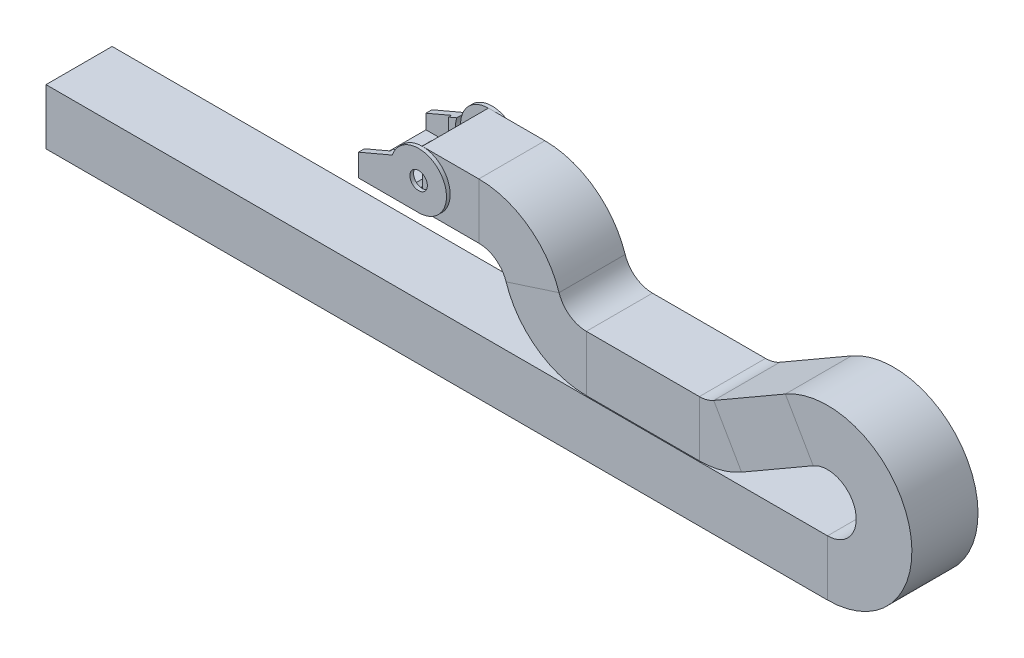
ISO-10303-21;
HEADER;
FILE_DESCRIPTION(('STEP AP214'),'2;1');
FILE_NAME('part.step','',(''),(''),'','','');
FILE_SCHEMA(('AUTOMOTIVE_DESIGN { 1 0 10303 214 1 1 1 1 }'));
ENDSEC;
DATA;
#1=APPLICATION_CONTEXT('core data for automotive mechanical design processes');
#2=APPLICATION_PROTOCOL_DEFINITION('international standard','automotive_design',2000,#1);
#3=PRODUCT_CONTEXT('',#1,'mechanical');
#4=PRODUCT('Part','Part','',(#3));
#5=PRODUCT_RELATED_PRODUCT_CATEGORY('part','',(#4));
#6=PRODUCT_DEFINITION_FORMATION('','',#4);
#7=PRODUCT_DEFINITION_CONTEXT('part definition',#1,'design');
#8=PRODUCT_DEFINITION('design','',#6,#7);
#9=PRODUCT_DEFINITION_SHAPE('','',#8);
#10=(LENGTH_UNIT() NAMED_UNIT(*) SI_UNIT(.MILLI.,.METRE.));
#11=(NAMED_UNIT(*) PLANE_ANGLE_UNIT() SI_UNIT($,.RADIAN.));
#12=(NAMED_UNIT(*) SI_UNIT($,.STERADIAN.) SOLID_ANGLE_UNIT());
#13=UNCERTAINTY_MEASURE_WITH_UNIT(LENGTH_MEASURE(1.E-05),#10,'distance_accuracy_value','');
#14=(GEOMETRIC_REPRESENTATION_CONTEXT(3) GLOBAL_UNCERTAINTY_ASSIGNED_CONTEXT((#13)) GLOBAL_UNIT_ASSIGNED_CONTEXT((#10,
#11,#12)) REPRESENTATION_CONTEXT('',''));
#15=CARTESIAN_POINT('',(0.,0.,0.));
#16=DIRECTION('',(0.,0.,1.));
#17=DIRECTION('',(1.,0.,0.));
#18=AXIS2_PLACEMENT_3D('',#15,#16,#17);
#19=CARTESIAN_POINT('',(0.,0.,29.718));
#20=DIRECTION('',(0.,0.,1.));
#21=DIRECTION('',(1.,0.,0.));
#22=AXIS2_PLACEMENT_3D('',#19,#20,#21);
#23=PLANE('',#22);
#24=DIRECTION('',(0.,-1.,0.));
#25=VECTOR('',#24,1.);
#26=CARTESIAN_POINT('',(-76.2,25.019,29.718));
#27=LINE('',#26,#25);
#28=CARTESIAN_POINT('',(-76.2,-7.874,29.718));
#29=VERTEX_POINT('',#28);
#30=CARTESIAN_POINT('',(-76.2,-25.019,29.718));
#31=VERTEX_POINT('',#30);
#32=EDGE_CURVE('E483',#29,#31,#27,.T.);
#33=ORIENTED_EDGE('',*,*,#32,.T.);
#34=DIRECTION('',(1.,0.,0.));
#35=VECTOR('',#34,1.);
#36=CARTESIAN_POINT('',(-86.6480176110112,-25.019,29.718));
#37=LINE('',#36,#35);
#38=CARTESIAN_POINT('',(-86.6480176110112,-25.019,29.718));
#39=VERTEX_POINT('',#38);
#40=EDGE_CURVE('E620',#39,#31,#37,.T.);
#41=ORIENTED_EDGE('',*,*,#40,.F.);
#42=DIRECTION('',(0.,-1.,0.));
#43=VECTOR('',#42,1.);
#44=CARTESIAN_POINT('',(-86.6480176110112,-22.733,29.718));
#45=LINE('',#44,#43);
#46=CARTESIAN_POINT('',(-86.6480176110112,-22.733,29.718));
#47=VERTEX_POINT('',#46);
#48=EDGE_CURVE('E624',#47,#39,#45,.T.);
#49=ORIENTED_EDGE('',*,*,#48,.F.);
#50=CARTESIAN_POINT('',(-76.2,0.,29.718));
#51=DIRECTION('',(0.,0.,1.));
#52=DIRECTION('',(1.,0.,0.));
#53=AXIS2_PLACEMENT_3D('',#50,#51,#52);
#54=CIRCLE('',#53,25.019);
#55=CARTESIAN_POINT('',(-99.9051547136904,8.001,29.718));
#56=VERTEX_POINT('',#55);
#57=EDGE_CURVE('E629',#56,#47,#54,.T.);
#58=ORIENTED_EDGE('',*,*,#57,.F.);
#59=CARTESIAN_POINT('',(-76.2,25.019,29.718));
#60=VERTEX_POINT('',#59);
#61=EDGE_CURVE('E51',#60,#56,#54,.T.);
#62=ORIENTED_EDGE('',*,*,#61,.F.);
#63=CARTESIAN_POINT('',(-76.2,7.874,29.718));
#64=VERTEX_POINT('',#63);
#65=EDGE_CURVE('E479',#60,#64,#27,.T.);
#66=ORIENTED_EDGE('',*,*,#65,.T.);
#67=CARTESIAN_POINT('',(-76.2,0.,29.718));
#68=DIRECTION('',(0.,0.,1.));
#69=DIRECTION('',(1.,0.,0.));
#70=AXIS2_PLACEMENT_3D('',#67,#68,#69);
#71=CIRCLE('',#70,7.874);
#72=EDGE_CURVE('E605',#64,#29,#71,.T.);
#73=ORIENTED_EDGE('',*,*,#72,.T.);
#74=EDGE_LOOP('',(#33,#41,#49,#58,#62,#66,#73));
#75=FACE_BOUND('',#74,.T.);
#76=ADVANCED_FACE('F35',(#75),#23,.F.);
#77=CARTESIAN_POINT('',(0.,0.,-29.718));
#78=DIRECTION('',(0.,0.,-1.));
#79=DIRECTION('',(1.,0.,0.));
#80=AXIS2_PLACEMENT_3D('',#77,#78,#79);
#81=PLANE('',#80);
#82=DIRECTION('',(0.,1.,0.));
#83=VECTOR('',#82,1.);
#84=CARTESIAN_POINT('',(-76.2,25.019,-29.718));
#85=LINE('',#84,#83);
#86=CARTESIAN_POINT('',(-76.2,7.874,-29.718));
#87=VERTEX_POINT('',#86);
#88=CARTESIAN_POINT('',(-76.2,25.019,-29.718));
#89=VERTEX_POINT('',#88);
#90=EDGE_CURVE('E59',#87,#89,#85,.T.);
#91=ORIENTED_EDGE('',*,*,#90,.T.);
#92=CARTESIAN_POINT('',(-76.2,0.,-29.718));
#93=DIRECTION('',(0.,0.,-1.));
#94=DIRECTION('',(-1.,0.,0.));
#95=AXIS2_PLACEMENT_3D('',#92,#93,#94);
#96=CIRCLE('',#95,25.019);
#97=CARTESIAN_POINT('',(-99.9051547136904,8.001,-29.718));
#98=VERTEX_POINT('',#97);
#99=EDGE_CURVE('E617',#89,#98,#96,.F.);
#100=ORIENTED_EDGE('',*,*,#99,.T.);
#101=CARTESIAN_POINT('',(-86.6480176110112,-22.733,-29.718));
#102=VERTEX_POINT('',#101);
#103=EDGE_CURVE('E618',#98,#102,#96,.F.);
#104=ORIENTED_EDGE('',*,*,#103,.T.);
#105=DIRECTION('',(0.,-1.,0.));
#106=VECTOR('',#105,1.);
#107=CARTESIAN_POINT('',(-86.6480176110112,-22.733,-29.718));
#108=LINE('',#107,#106);
#109=CARTESIAN_POINT('',(-86.6480176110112,-25.019,-29.718));
#110=VERTEX_POINT('',#109);
#111=EDGE_CURVE('E608',#102,#110,#108,.T.);
#112=ORIENTED_EDGE('',*,*,#111,.T.);
#113=DIRECTION('',(1.,0.,0.));
#114=VECTOR('',#113,1.);
#115=CARTESIAN_POINT('',(-86.6480176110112,-25.019,-29.718));
#116=LINE('',#115,#114);
#117=CARTESIAN_POINT('',(-76.2,-25.019,-29.718));
#118=VERTEX_POINT('',#117);
#119=EDGE_CURVE('E612',#110,#118,#116,.T.);
#120=ORIENTED_EDGE('',*,*,#119,.T.);
#121=CARTESIAN_POINT('',(-76.2,-7.874,-29.718));
#122=VERTEX_POINT('',#121);
#123=EDGE_CURVE('E575',#118,#122,#85,.T.);
#124=ORIENTED_EDGE('',*,*,#123,.T.);
#125=CARTESIAN_POINT('',(-76.2,0.,-29.718));
#126=DIRECTION('',(0.,0.,-1.));
#127=DIRECTION('',(-1.,0.,0.));
#128=AXIS2_PLACEMENT_3D('',#125,#126,#127);
#129=CIRCLE('',#128,7.874);
#130=EDGE_CURVE('E602',#122,#87,#129,.T.);
#131=ORIENTED_EDGE('',*,*,#130,.T.);
#132=EDGE_LOOP('',(#91,#100,#104,#112,#120,#124,#131));
#133=FACE_BOUND('',#132,.T.);
#134=ADVANCED_FACE('F915',(#133),#81,.F.);
#135=CARTESIAN_POINT('',(-107.188,-17.907,65.4898962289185));
#136=DIRECTION('',(0.,1.,0.));
#137=DIRECTION('',(0.,0.,1.));
#138=AXIS2_PLACEMENT_3D('',#135,#136,#137);
#139=PLANE('',#138);
#140=DIRECTION('',(0.,0.,-1.));
#141=VECTOR('',#140,1.);
#142=CARTESIAN_POINT('',(-107.188,-17.907,20.701));
#143=LINE('',#142,#141);
#144=CARTESIAN_POINT('',(-107.188,-17.907,20.701));
#145=VERTEX_POINT('',#144);
#146=CARTESIAN_POINT('',(-107.188,-17.907,9.27100000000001));
#147=VERTEX_POINT('',#146);
#148=EDGE_CURVE('E703',#145,#147,#143,.T.);
#149=ORIENTED_EDGE('',*,*,#148,.F.);
#150=CARTESIAN_POINT('',(-113.284,-17.907,20.701));
#151=DIRECTION('',(0.,-1.,0.));
#152=DIRECTION('',(0.,0.,1.));
#153=AXIS2_PLACEMENT_3D('',#150,#151,#152);
#154=CIRCLE('',#153,6.09600000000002);
#155=CARTESIAN_POINT('',(-119.38,-17.907,20.701));
#156=VERTEX_POINT('',#155);
#157=EDGE_CURVE('E712',#156,#145,#154,.F.);
#158=ORIENTED_EDGE('',*,*,#157,.F.);
#159=DIRECTION('',(0.,0.,1.));
#160=VECTOR('',#159,1.);
#161=CARTESIAN_POINT('',(-119.38,-17.907,9.27100000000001));
#162=LINE('',#161,#160);
#163=CARTESIAN_POINT('',(-119.38,-17.907,9.27100000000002));
#164=VERTEX_POINT('',#163);
#165=EDGE_CURVE('E717',#164,#156,#162,.T.);
#166=ORIENTED_EDGE('',*,*,#165,.F.);
#167=CARTESIAN_POINT('',(-113.284,-17.907,9.271));
#168=DIRECTION('',(0.,-1.,0.));
#169=DIRECTION('',(0.,0.,1.));
#170=AXIS2_PLACEMENT_3D('',#167,#168,#169);
#171=CIRCLE('',#170,6.09600000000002);
#172=EDGE_CURVE('E721',#147,#164,#171,.F.);
#173=ORIENTED_EDGE('',*,*,#172,.F.);
#174=EDGE_LOOP('',(#149,#158,#166,#173));
#175=FACE_BOUND('',#174,.T.);
#176=DIRECTION('',(0.,0.,-1.));
#177=VECTOR('',#176,1.);
#178=CARTESIAN_POINT('',(-107.188,-17.907,-20.701));
#179=LINE('',#178,#177);
#180=CARTESIAN_POINT('',(-107.188,-17.907,-20.701));
#181=VERTEX_POINT('',#180);
#182=CARTESIAN_POINT('',(-107.188,-17.907,-9.27100000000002));
#183=VERTEX_POINT('',#182);
#184=EDGE_CURVE('E661',#181,#183,#179,.F.);
#185=ORIENTED_EDGE('',*,*,#184,.T.);
#186=CARTESIAN_POINT('',(-113.284,-17.907,-9.271));
#187=DIRECTION('',(0.,-1.,0.));
#188=DIRECTION('',(0.,0.,1.));
#189=AXIS2_PLACEMENT_3D('',#186,#187,#188);
#190=CIRCLE('',#189,6.09600000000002);
#191=CARTESIAN_POINT('',(-119.38,-17.907,-9.27100000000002));
#192=VERTEX_POINT('',#191);
#193=EDGE_CURVE('E657',#183,#192,#190,.T.);
#194=ORIENTED_EDGE('',*,*,#193,.T.);
#195=DIRECTION('',(0.,0.,1.));
#196=VECTOR('',#195,1.);
#197=CARTESIAN_POINT('',(-119.38,-17.907,-9.27100000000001));
#198=LINE('',#197,#196);
#199=CARTESIAN_POINT('',(-119.38,-17.907,-20.701));
#200=VERTEX_POINT('',#199);
#201=EDGE_CURVE('E667',#192,#200,#198,.F.);
#202=ORIENTED_EDGE('',*,*,#201,.T.);
#203=CARTESIAN_POINT('',(-113.284,-17.907,-20.701));
#204=DIRECTION('',(0.,-1.,0.));
#205=DIRECTION('',(0.,0.,1.));
#206=AXIS2_PLACEMENT_3D('',#203,#204,#205);
#207=CIRCLE('',#206,6.09600000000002);
#208=EDGE_CURVE('E664',#200,#181,#207,.T.);
#209=ORIENTED_EDGE('',*,*,#208,.T.);
#210=EDGE_LOOP('',(#185,#194,#202,#209));
#211=FACE_BOUND('',#210,.T.);
#212=DIRECTION('',(-1.,0.,0.));
#213=VECTOR('',#212,1.);
#214=CARTESIAN_POINT('',(-90.424,-17.907,25.019));
#215=LINE('',#214,#213);
#216=CARTESIAN_POINT('',(-93.6725416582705,-17.907,25.019));
#217=VERTEX_POINT('',#216);
#218=CARTESIAN_POINT('',(-107.188,-17.907,25.019));
#219=VERTEX_POINT('',#218);
#220=EDGE_CURVE('E804',#217,#219,#215,.T.);
#221=ORIENTED_EDGE('',*,*,#220,.F.);
#222=DIRECTION('',(0.,0.,-1.));
#223=VECTOR('',#222,1.);
#224=CARTESIAN_POINT('',(-93.6725416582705,-17.907,100.482418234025));
#225=LINE('',#224,#223);
#226=CARTESIAN_POINT('',(-93.6725416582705,-17.907,-25.019));
#227=VERTEX_POINT('',#226);
#228=EDGE_CURVE('E623',#217,#227,#225,.T.);
#229=ORIENTED_EDGE('',*,*,#228,.T.);
#230=DIRECTION('',(-1.,0.,0.));
#231=VECTOR('',#230,1.);
#232=CARTESIAN_POINT('',(-90.424,-17.907,-25.019));
#233=LINE('',#232,#231);
#234=CARTESIAN_POINT('',(-107.188,-17.907,-25.019));
#235=VERTEX_POINT('',#234);
#236=EDGE_CURVE('E794',#227,#235,#233,.T.);
#237=ORIENTED_EDGE('',*,*,#236,.T.);
#238=DIRECTION('',(0.,0.,-1.));
#239=VECTOR('',#238,1.);
#240=CARTESIAN_POINT('',(-107.188,-17.907,65.4898962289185));
#241=LINE('',#240,#239);
#242=CARTESIAN_POINT('',(-107.188,-17.907,-27.686));
#243=VERTEX_POINT('',#242);
#244=EDGE_CURVE('E843',#235,#243,#241,.T.);
#245=ORIENTED_EDGE('',*,*,#244,.T.);
#246=DIRECTION('',(1.,0.,0.));
#247=VECTOR('',#246,1.);
#248=CARTESIAN_POINT('',(-107.188,-17.907,-27.686));
#249=LINE('',#248,#247);
#250=CARTESIAN_POINT('',(-130.302,-17.907,-27.686));
#251=VERTEX_POINT('',#250);
#252=EDGE_CURVE('E816',#251,#243,#249,.T.);
#253=ORIENTED_EDGE('',*,*,#252,.F.);
#254=DIRECTION('',(0.,0.,-1.));
#255=VECTOR('',#254,1.);
#256=CARTESIAN_POINT('',(-130.302,-17.907,65.4898962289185));
#257=LINE('',#256,#255);
#258=CARTESIAN_POINT('',(-130.302,-17.907,27.686));
#259=VERTEX_POINT('',#258);
#260=EDGE_CURVE('E839',#259,#251,#257,.T.);
#261=ORIENTED_EDGE('',*,*,#260,.F.);
#262=DIRECTION('',(-1.,0.,0.));
#263=VECTOR('',#262,1.);
#264=CARTESIAN_POINT('',(-107.188,-17.907,27.686));
#265=LINE('',#264,#263);
#266=CARTESIAN_POINT('',(-107.188,-17.907,27.686));
#267=VERTEX_POINT('',#266);
#268=EDGE_CURVE('E827',#267,#259,#265,.T.);
#269=ORIENTED_EDGE('',*,*,#268,.F.);
#270=EDGE_CURVE('E844',#267,#219,#241,.T.);
#271=ORIENTED_EDGE('',*,*,#270,.T.);
#272=EDGE_LOOP('',(#221,#229,#237,#245,#253,#261,#269,#271));
#273=FACE_BOUND('',#272,.T.);
#274=ADVANCED_FACE('F983',(#175,#211,#273),#139,.T.);
#275=CARTESIAN_POINT('',(-76.2,-25.019,33.02));
#276=DIRECTION('',(0.,1.,0.));
#277=DIRECTION('',(0.,0.,1.));
#278=AXIS2_PLACEMENT_3D('',#275,#276,#277);
#279=PLANE('',#278);
#280=DIRECTION('',(0.,0.,-1.));
#281=VECTOR('',#280,1.);
#282=CARTESIAN_POINT('',(-110.236,-25.019,20.701));
#283=LINE('',#282,#281);
#284=CARTESIAN_POINT('',(-110.236,-25.019,20.701));
#285=VERTEX_POINT('',#284);
#286=CARTESIAN_POINT('',(-110.236,-25.019,9.27100000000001));
#287=VERTEX_POINT('',#286);
#288=EDGE_CURVE('E745',#285,#287,#283,.T.);
#289=ORIENTED_EDGE('',*,*,#288,.T.);
#290=CARTESIAN_POINT('',(-113.284,-25.019,9.271));
#291=DIRECTION('',(0.,1.,0.));
#292=DIRECTION('',(0.,0.,-1.));
#293=AXIS2_PLACEMENT_3D('',#290,#291,#292);
#294=CIRCLE('',#293,3.04800000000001);
#295=CARTESIAN_POINT('',(-116.332,-25.019,9.27100000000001));
#296=VERTEX_POINT('',#295);
#297=EDGE_CURVE('E748',#287,#296,#294,.T.);
#298=ORIENTED_EDGE('',*,*,#297,.T.);
#299=DIRECTION('',(0.,0.,1.));
#300=VECTOR('',#299,1.);
#301=CARTESIAN_POINT('',(-116.332,-25.019,20.701));
#302=LINE('',#301,#300);
#303=CARTESIAN_POINT('',(-116.332,-25.019,20.701));
#304=VERTEX_POINT('',#303);
#305=EDGE_CURVE('E733',#296,#304,#302,.T.);
#306=ORIENTED_EDGE('',*,*,#305,.T.);
#307=CARTESIAN_POINT('',(-113.284,-25.019,20.701));
#308=DIRECTION('',(0.,1.,0.));
#309=DIRECTION('',(0.,0.,-1.));
#310=AXIS2_PLACEMENT_3D('',#307,#308,#309);
#311=CIRCLE('',#310,3.04800000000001);
#312=EDGE_CURVE('E728',#304,#285,#311,.T.);
#313=ORIENTED_EDGE('',*,*,#312,.T.);
#314=EDGE_LOOP('',(#289,#298,#306,#313));
#315=FACE_BOUND('',#314,.T.);
#316=CARTESIAN_POINT('',(-113.284,-25.019,-20.701));
#317=DIRECTION('',(0.,-1.,0.));
#318=DIRECTION('',(0.,0.,1.));
#319=AXIS2_PLACEMENT_3D('',#316,#317,#318);
#320=CIRCLE('',#319,3.04800000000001);
#321=CARTESIAN_POINT('',(-116.332,-25.019,-20.701));
#322=VERTEX_POINT('',#321);
#323=CARTESIAN_POINT('',(-110.236,-25.019,-20.701));
#324=VERTEX_POINT('',#323);
#325=EDGE_CURVE('E660',#322,#324,#320,.T.);
#326=ORIENTED_EDGE('',*,*,#325,.F.);
#327=DIRECTION('',(0.,0.,-1.));
#328=VECTOR('',#327,1.);
#329=CARTESIAN_POINT('',(-116.332,-25.019,-20.701));
#330=LINE('',#329,#328);
#331=CARTESIAN_POINT('',(-116.332,-25.019,-9.27100000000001));
#332=VERTEX_POINT('',#331);
#333=EDGE_CURVE('E693',#332,#322,#330,.T.);
#334=ORIENTED_EDGE('',*,*,#333,.F.);
#335=CARTESIAN_POINT('',(-113.284,-25.019,-9.271));
#336=DIRECTION('',(0.,-1.,0.));
#337=DIRECTION('',(0.,0.,1.));
#338=AXIS2_PLACEMENT_3D('',#335,#336,#337);
#339=CIRCLE('',#338,3.04800000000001);
#340=CARTESIAN_POINT('',(-110.236,-25.019,-9.27100000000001));
#341=VERTEX_POINT('',#340);
#342=EDGE_CURVE('E696',#341,#332,#339,.T.);
#343=ORIENTED_EDGE('',*,*,#342,.F.);
#344=DIRECTION('',(0.,0.,1.));
#345=VECTOR('',#344,1.);
#346=CARTESIAN_POINT('',(-110.236,-25.019,-20.701));
#347=LINE('',#346,#345);
#348=EDGE_CURVE('E681',#324,#341,#347,.T.);
#349=ORIENTED_EDGE('',*,*,#348,.F.);
#350=EDGE_LOOP('',(#326,#334,#343,#349));
#351=FACE_BOUND('',#350,.T.);
#352=DIRECTION('',(0.,0.,-1.));
#353=VECTOR('',#352,1.);
#354=CARTESIAN_POINT('',(-86.6480176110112,-25.019,100.482418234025));
#355=LINE('',#354,#353);
#356=CARTESIAN_POINT('',(-86.6480176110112,-25.019,25.019));
#357=VERTEX_POINT('',#356);
#358=EDGE_CURVE('E634',#39,#357,#355,.T.);
#359=ORIENTED_EDGE('',*,*,#358,.F.);
#360=ORIENTED_EDGE('',*,*,#40,.T.);
#361=DIRECTION('',(0.,0.,-1.));
#362=VECTOR('',#361,1.);
#363=CARTESIAN_POINT('',(-76.2,-25.019,33.02));
#364=LINE('',#363,#362);
#365=CARTESIAN_POINT('',(-76.2,-25.019,33.02));
#366=VERTEX_POINT('',#365);
#367=EDGE_CURVE('E880',#366,#31,#364,.T.);
#368=ORIENTED_EDGE('',*,*,#367,.F.);
#369=DIRECTION('',(-1.,0.,0.));
#370=VECTOR('',#369,1.);
#371=CARTESIAN_POINT('',(-76.2,-25.019,33.02));
#372=LINE('',#371,#370);
#373=CARTESIAN_POINT('',(-130.302,-25.019,33.02));
#374=VERTEX_POINT('',#373);
#375=EDGE_CURVE('E849',#366,#374,#372,.T.);
#376=ORIENTED_EDGE('',*,*,#375,.T.);
#377=DIRECTION('',(0.,0.,-1.));
#378=VECTOR('',#377,1.);
#379=CARTESIAN_POINT('',(-130.302,-25.019,33.02));
#380=LINE('',#379,#378);
#381=CARTESIAN_POINT('',(-130.302,-25.019,27.686));
#382=VERTEX_POINT('',#381);
#383=EDGE_CURVE('E876',#374,#382,#380,.T.);
#384=ORIENTED_EDGE('',*,*,#383,.T.);
#385=DIRECTION('',(1.,0.,0.));
#386=VECTOR('',#385,1.);
#387=CARTESIAN_POINT('',(-120.396,-25.019,27.686));
#388=LINE('',#387,#386);
#389=CARTESIAN_POINT('',(-120.396,-25.019,27.686));
#390=VERTEX_POINT('',#389);
#391=EDGE_CURVE('E765',#382,#390,#388,.T.);
#392=ORIENTED_EDGE('',*,*,#391,.T.);
#393=DIRECTION('',(0.,0.,-1.));
#394=VECTOR('',#393,1.);
#395=CARTESIAN_POINT('',(-120.396,-25.019,-27.686));
#396=LINE('',#395,#394);
#397=CARTESIAN_POINT('',(-120.396,-25.019,-27.686));
#398=VERTEX_POINT('',#397);
#399=EDGE_CURVE('E755',#390,#398,#396,.T.);
#400=ORIENTED_EDGE('',*,*,#399,.T.);
#401=DIRECTION('',(-1.,0.,0.));
#402=VECTOR('',#401,1.);
#403=CARTESIAN_POINT('',(-120.396,-25.019,-27.686));
#404=LINE('',#403,#402);
#405=CARTESIAN_POINT('',(-130.302,-25.019,-27.686));
#406=VERTEX_POINT('',#405);
#407=EDGE_CURVE('E775',#398,#406,#404,.T.);
#408=ORIENTED_EDGE('',*,*,#407,.T.);
#409=CARTESIAN_POINT('',(-130.302,-25.019,-33.02));
#410=VERTEX_POINT('',#409);
#411=EDGE_CURVE('E875',#406,#410,#380,.T.);
#412=ORIENTED_EDGE('',*,*,#411,.T.);
#413=DIRECTION('',(-1.,0.,0.));
#414=VECTOR('',#413,1.);
#415=CARTESIAN_POINT('',(-76.2,-25.019,-33.02));
#416=LINE('',#415,#414);
#417=CARTESIAN_POINT('',(-76.2,-25.019,-33.02));
#418=VERTEX_POINT('',#417);
#419=EDGE_CURVE('E830',#418,#410,#416,.T.);
#420=ORIENTED_EDGE('',*,*,#419,.F.);
#421=EDGE_CURVE('E879',#118,#418,#364,.T.);
#422=ORIENTED_EDGE('',*,*,#421,.F.);
#423=ORIENTED_EDGE('',*,*,#119,.F.);
#424=CARTESIAN_POINT('',(-86.6480176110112,-25.019,-25.019));
#425=VERTEX_POINT('',#424);
#426=EDGE_CURVE('E633',#425,#110,#355,.T.);
#427=ORIENTED_EDGE('',*,*,#426,.F.);
#428=DIRECTION('',(-1.,0.,0.));
#429=VECTOR('',#428,1.);
#430=CARTESIAN_POINT('',(-76.2,-25.019,-25.019));
#431=LINE('',#430,#429);
#432=CARTESIAN_POINT('',(-90.424,-25.019,-25.019));
#433=VERTEX_POINT('',#432);
#434=EDGE_CURVE('E788',#425,#433,#431,.T.);
#435=ORIENTED_EDGE('',*,*,#434,.T.);
#436=DIRECTION('',(0.,0.,1.));
#437=VECTOR('',#436,1.);
#438=CARTESIAN_POINT('',(-90.424,-25.019,-25.019));
#439=LINE('',#438,#437);
#440=CARTESIAN_POINT('',(-90.424,-25.019,25.019));
#441=VERTEX_POINT('',#440);
#442=EDGE_CURVE('E799',#433,#441,#439,.T.);
#443=ORIENTED_EDGE('',*,*,#442,.T.);
#444=DIRECTION('',(-1.,0.,0.));
#445=VECTOR('',#444,1.);
#446=CARTESIAN_POINT('',(-76.2,-25.019,25.019));
#447=LINE('',#446,#445);
#448=EDGE_CURVE('E782',#357,#441,#447,.T.);
#449=ORIENTED_EDGE('',*,*,#448,.F.);
#450=EDGE_LOOP('',(#359,#360,#368,#376,#384,#392,#400,#408,#412,#420,#422,#423,#427,#435,#443,#449));
#451=FACE_BOUND('',#450,.T.);
#452=ADVANCED_FACE('F903',(#315,#351,#451),#279,.F.);
#453=CARTESIAN_POINT('',(-90.424,-25.019,-25.019));
#454=DIRECTION('',(-1.,0.,0.));
#455=DIRECTION('',(0.,0.,-1.));
#456=AXIS2_PLACEMENT_3D('',#453,#454,#455);
#457=PLANE('',#456);
#458=DIRECTION('',(0.,0.,-1.));
#459=VECTOR('',#458,1.);
#460=CARTESIAN_POINT('',(-90.424,-20.5822298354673,100.482418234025));
#461=LINE('',#460,#459);
#462=CARTESIAN_POINT('',(-90.424,-20.5822298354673,25.019));
#463=VERTEX_POINT('',#462);
#464=CARTESIAN_POINT('',(-90.424,-20.5822298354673,-25.019));
#465=VERTEX_POINT('',#464);
#466=EDGE_CURVE('E641',#463,#465,#461,.T.);
#467=ORIENTED_EDGE('',*,*,#466,.F.);
#468=DIRECTION('',(0.,1.,0.));
#469=VECTOR('',#468,1.);
#470=CARTESIAN_POINT('',(-90.424,-25.019,25.019));
#471=LINE('',#470,#469);
#472=EDGE_CURVE('E801',#441,#463,#471,.T.);
#473=ORIENTED_EDGE('',*,*,#472,.F.);
#474=ORIENTED_EDGE('',*,*,#442,.F.);
#475=DIRECTION('',(0.,1.,0.));
#476=VECTOR('',#475,1.);
#477=CARTESIAN_POINT('',(-90.424,-25.019,-25.019));
#478=LINE('',#477,#476);
#479=EDGE_CURVE('E790',#433,#465,#478,.T.);
#480=ORIENTED_EDGE('',*,*,#479,.T.);
#481=EDGE_LOOP('',(#467,#473,#474,#480));
#482=FACE_BOUND('',#481,.T.);
#483=ADVANCED_FACE('F896',(#482),#457,.F.);
#484=CARTESIAN_POINT('',(-76.2,0.,-25.019));
#485=DIRECTION('',(0.,0.,1.));
#486=DIRECTION('',(-1.,0.,0.));
#487=AXIS2_PLACEMENT_3D('',#484,#485,#486);
#488=PLANE('',#487);
#489=ORIENTED_EDGE('',*,*,#434,.F.);
#490=DIRECTION('',(0.,1.,0.));
#491=VECTOR('',#490,1.);
#492=CARTESIAN_POINT('',(-86.6480176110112,0.,-25.019));
#493=LINE('',#492,#491);
#494=CARTESIAN_POINT('',(-86.6480176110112,-22.733,-25.019));
#495=VERTEX_POINT('',#494);
#496=EDGE_CURVE('E647',#425,#495,#493,.T.);
#497=ORIENTED_EDGE('',*,*,#496,.T.);
#498=CARTESIAN_POINT('',(-76.2,0.,-25.019));
#499=DIRECTION('',(0.,0.,1.));
#500=DIRECTION('',(1.,0.,0.));
#501=AXIS2_PLACEMENT_3D('',#498,#499,#500);
#502=CIRCLE('',#501,25.019);
#503=EDGE_CURVE('E642',#495,#465,#502,.F.);
#504=ORIENTED_EDGE('',*,*,#503,.T.);
#505=ORIENTED_EDGE('',*,*,#479,.F.);
#506=EDGE_LOOP('',(#489,#497,#504,#505));
#507=FACE_BOUND('',#506,.T.);
#508=ADVANCED_FACE('F908',(#507),#488,.T.);
#509=ORIENTED_EDGE('',*,*,#236,.F.);
#510=CARTESIAN_POINT('',(-99.9051547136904,8.001,-25.019));
#511=VERTEX_POINT('',#510);
#512=EDGE_CURVE('E638',#227,#511,#502,.F.);
#513=ORIENTED_EDGE('',*,*,#512,.T.);
#514=DIRECTION('',(0.919945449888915,0.392046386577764,0.));
#515=VECTOR('',#514,1.);
#516=CARTESIAN_POINT('',(-130.302,-4.953,-25.019));
#517=LINE('',#516,#515);
#518=CARTESIAN_POINT('',(-107.188,4.89732338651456,-25.019));
#519=VERTEX_POINT('',#518);
#520=EDGE_CURVE('E796',#519,#511,#517,.T.);
#521=ORIENTED_EDGE('',*,*,#520,.F.);
#522=DIRECTION('',(0.,-1.,0.));
#523=VECTOR('',#522,1.);
#524=CARTESIAN_POINT('',(-107.188,4.89732338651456,-25.019));
#525=LINE('',#524,#523);
#526=EDGE_CURVE('E813',#519,#235,#525,.T.);
#527=ORIENTED_EDGE('',*,*,#526,.T.);
#528=EDGE_LOOP('',(#509,#513,#521,#527));
#529=FACE_BOUND('',#528,.T.);
#530=ADVANCED_FACE('F1072',(#529),#488,.T.);
#531=CARTESIAN_POINT('',(-76.2,0.,25.019));
#532=DIRECTION('',(0.,0.,1.));
#533=DIRECTION('',(-1.,0.,0.));
#534=AXIS2_PLACEMENT_3D('',#531,#532,#533);
#535=PLANE('',#534);
#536=DIRECTION('',(0.,1.,0.));
#537=VECTOR('',#536,1.);
#538=CARTESIAN_POINT('',(-86.6480176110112,0.,25.019));
#539=LINE('',#538,#537);
#540=CARTESIAN_POINT('',(-86.6480176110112,-22.733,25.019));
#541=VERTEX_POINT('',#540);
#542=EDGE_CURVE('E12',#357,#541,#539,.T.);
#543=ORIENTED_EDGE('',*,*,#542,.F.);
#544=ORIENTED_EDGE('',*,*,#448,.T.);
#545=ORIENTED_EDGE('',*,*,#472,.T.);
#546=CARTESIAN_POINT('',(-76.2,0.,25.019));
#547=DIRECTION('',(0.,0.,1.));
#548=DIRECTION('',(1.,0.,0.));
#549=AXIS2_PLACEMENT_3D('',#546,#547,#548);
#550=CIRCLE('',#549,25.019);
#551=EDGE_CURVE('E44',#541,#463,#550,.F.);
#552=ORIENTED_EDGE('',*,*,#551,.F.);
#553=EDGE_LOOP('',(#543,#544,#545,#552));
#554=FACE_BOUND('',#553,.T.);
#555=ADVANCED_FACE('F899',(#554),#535,.F.);
#556=CARTESIAN_POINT('',(-99.9051547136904,8.001,25.019));
#557=VERTEX_POINT('',#556);
#558=EDGE_CURVE('E883',#217,#557,#550,.F.);
#559=ORIENTED_EDGE('',*,*,#558,.F.);
#560=ORIENTED_EDGE('',*,*,#220,.T.);
#561=DIRECTION('',(0.,-1.,0.));
#562=VECTOR('',#561,1.);
#563=CARTESIAN_POINT('',(-107.188,4.89732338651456,25.019));
#564=LINE('',#563,#562);
#565=CARTESIAN_POINT('',(-107.188,4.89732338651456,25.019));
#566=VERTEX_POINT('',#565);
#567=EDGE_CURVE('E810',#566,#219,#564,.T.);
#568=ORIENTED_EDGE('',*,*,#567,.F.);
#569=DIRECTION('',(0.919945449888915,0.392046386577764,0.));
#570=VECTOR('',#569,1.);
#571=CARTESIAN_POINT('',(-130.302,-4.953,25.019));
#572=LINE('',#571,#570);
#573=EDGE_CURVE('E791',#566,#557,#572,.T.);
#574=ORIENTED_EDGE('',*,*,#573,.T.);
#575=EDGE_LOOP('',(#559,#560,#568,#574));
#576=FACE_BOUND('',#575,.T.);
#577=ADVANCED_FACE('F1075',(#576),#535,.F.);
#578=CARTESIAN_POINT('',(-76.2,0.,33.02));
#579=DIRECTION('',(0.,0.,-1.));
#580=DIRECTION('',(1.,0.,0.));
#581=AXIS2_PLACEMENT_3D('',#578,#579,#580);
#582=CYLINDRICAL_SURFACE('',#581,25.019);
#583=DIRECTION('',(0.,0.,-1.));
#584=VECTOR('',#583,1.);
#585=CARTESIAN_POINT('',(-99.9051547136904,8.001,33.02));
#586=LINE('',#585,#584);
#587=CARTESIAN_POINT('',(-99.9051547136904,8.001,-33.02));
#588=VERTEX_POINT('',#587);
#589=EDGE_CURVE('E859',#98,#588,#586,.T.);
#590=ORIENTED_EDGE('',*,*,#589,.F.);
#591=ORIENTED_EDGE('',*,*,#99,.F.);
#592=EDGE_CURVE('E613',#118,#89,#96,.F.);
#593=ORIENTED_EDGE('',*,*,#592,.F.);
#594=ORIENTED_EDGE('',*,*,#421,.T.);
#595=CARTESIAN_POINT('',(-76.2,0.,-33.02));
#596=DIRECTION('',(0.,0.,1.));
#597=DIRECTION('',(1.,0.,0.));
#598=AXIS2_PLACEMENT_3D('',#595,#596,#597);
#599=CIRCLE('',#598,25.019);
#600=EDGE_CURVE('E650',#418,#588,#599,.T.);
#601=ORIENTED_EDGE('',*,*,#600,.T.);
#602=EDGE_LOOP('',(#590,#591,#593,#594,#601));
#603=FACE_BOUND('',#602,.T.);
#604=ADVANCED_FACE('F1541',(#603),#582,.T.);
#605=ORIENTED_EDGE('',*,*,#367,.T.);
#606=EDGE_CURVE('E627',#31,#60,#54,.T.);
#607=ORIENTED_EDGE('',*,*,#606,.T.);
#608=ORIENTED_EDGE('',*,*,#61,.T.);
#609=CARTESIAN_POINT('',(-99.9051547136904,8.001,33.02));
#610=VERTEX_POINT('',#609);
#611=EDGE_CURVE('E867',#610,#56,#586,.T.);
#612=ORIENTED_EDGE('',*,*,#611,.F.);
#613=CARTESIAN_POINT('',(-76.2,0.,33.02));
#614=DIRECTION('',(0.,0.,1.));
#615=DIRECTION('',(1.,0.,0.));
#616=AXIS2_PLACEMENT_3D('',#613,#614,#615);
#617=CIRCLE('',#616,25.019);
#618=EDGE_CURVE('E653',#366,#610,#617,.T.);
#619=ORIENTED_EDGE('',*,*,#618,.F.);
#620=EDGE_LOOP('',(#605,#607,#608,#612,#619));
#621=FACE_BOUND('',#620,.T.);
#622=ADVANCED_FACE('F37',(#621),#582,.T.);
#623=CARTESIAN_POINT('',(-130.302,-4.953,33.02));
#624=DIRECTION('',(0.392046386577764,-0.919945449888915,0.));
#625=DIRECTION('',(-0.919945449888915,-0.392046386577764,0.));
#626=AXIS2_PLACEMENT_3D('',#623,#624,#625);
#627=PLANE('',#626);
#628=ORIENTED_EDGE('',*,*,#520,.T.);
#629=EDGE_CURVE('E871',#511,#98,#586,.T.);
#630=ORIENTED_EDGE('',*,*,#629,.T.);
#631=ORIENTED_EDGE('',*,*,#589,.T.);
#632=DIRECTION('',(0.919945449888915,0.392046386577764,0.));
#633=VECTOR('',#632,1.);
#634=CARTESIAN_POINT('',(-130.302,-4.953,-33.02));
#635=LINE('',#634,#633);
#636=CARTESIAN_POINT('',(-130.302,-4.953,-33.02));
#637=VERTEX_POINT('',#636);
#638=EDGE_CURVE('E853',#637,#588,#635,.T.);
#639=ORIENTED_EDGE('',*,*,#638,.F.);
#640=DIRECTION('',(0.,0.,-1.));
#641=VECTOR('',#640,1.);
#642=CARTESIAN_POINT('',(-130.302,-4.953,33.02));
#643=LINE('',#642,#641);
#644=CARTESIAN_POINT('',(-130.302,-4.953,-27.686));
#645=VERTEX_POINT('',#644);
#646=EDGE_CURVE('E870',#645,#637,#643,.T.);
#647=ORIENTED_EDGE('',*,*,#646,.F.);
#648=DIRECTION('',(-0.919945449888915,-0.392046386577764,0.));
#649=VECTOR('',#648,1.);
#650=CARTESIAN_POINT('',(-130.302,-4.953,-27.686));
#651=LINE('',#650,#649);
#652=CARTESIAN_POINT('',(-107.188,4.89732338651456,-27.686));
#653=VERTEX_POINT('',#652);
#654=EDGE_CURVE('E821',#653,#645,#651,.T.);
#655=ORIENTED_EDGE('',*,*,#654,.F.);
#656=DIRECTION('',(0.,0.,-1.));
#657=VECTOR('',#656,1.);
#658=CARTESIAN_POINT('',(-107.188,4.89732338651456,65.4898962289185));
#659=LINE('',#658,#657);
#660=EDGE_CURVE('E826',#519,#653,#659,.T.);
#661=ORIENTED_EDGE('',*,*,#660,.F.);
#662=EDGE_LOOP('',(#628,#630,#631,#639,#647,#655,#661));
#663=FACE_BOUND('',#662,.T.);
#664=ADVANCED_FACE('F1106',(#663),#627,.F.);
#665=CARTESIAN_POINT('',(-107.188,4.89732338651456,65.4898962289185));
#666=DIRECTION('',(-1.,0.,0.));
#667=DIRECTION('',(0.,1.,0.));
#668=AXIS2_PLACEMENT_3D('',#665,#666,#667);
#669=PLANE('',#668);
#670=ORIENTED_EDGE('',*,*,#660,.T.);
#671=DIRECTION('',(0.,1.,0.));
#672=VECTOR('',#671,1.);
#673=CARTESIAN_POINT('',(-107.188,4.89732338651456,-27.686));
#674=LINE('',#673,#672);
#675=EDGE_CURVE('E824',#243,#653,#674,.T.);
#676=ORIENTED_EDGE('',*,*,#675,.F.);
#677=ORIENTED_EDGE('',*,*,#244,.F.);
#678=ORIENTED_EDGE('',*,*,#526,.F.);
#679=EDGE_LOOP('',(#670,#676,#677,#678));
#680=FACE_BOUND('',#679,.T.);
#681=ADVANCED_FACE('F1090',(#680),#669,.T.);
#682=CARTESIAN_POINT('',(-130.302,-25.019,33.02));
#683=DIRECTION('',(1.,0.,0.));
#684=DIRECTION('',(0.,0.,1.));
#685=AXIS2_PLACEMENT_3D('',#682,#683,#684);
#686=PLANE('',#685);
#687=ORIENTED_EDGE('',*,*,#383,.F.);
#688=DIRECTION('',(0.,1.,0.));
#689=VECTOR('',#688,1.);
#690=CARTESIAN_POINT('',(-130.302,-25.019,33.02));
#691=LINE('',#690,#689);
#692=CARTESIAN_POINT('',(-130.302,-4.953,33.02));
#693=VERTEX_POINT('',#692);
#694=EDGE_CURVE('E852',#374,#693,#691,.T.);
#695=ORIENTED_EDGE('',*,*,#694,.T.);
#696=CARTESIAN_POINT('',(-130.302,-4.953,27.686));
#697=VERTEX_POINT('',#696);
#698=EDGE_CURVE('E872',#693,#697,#643,.T.);
#699=ORIENTED_EDGE('',*,*,#698,.T.);
#700=DIRECTION('',(0.,1.,0.));
#701=VECTOR('',#700,1.);
#702=CARTESIAN_POINT('',(-130.302,-17.907,27.686));
#703=LINE('',#702,#701);
#704=EDGE_CURVE('E836',#259,#697,#703,.T.);
#705=ORIENTED_EDGE('',*,*,#704,.F.);
#706=ORIENTED_EDGE('',*,*,#260,.T.);
#707=DIRECTION('',(0.,-1.,0.));
#708=VECTOR('',#707,1.);
#709=CARTESIAN_POINT('',(-130.302,-17.907,-27.686));
#710=LINE('',#709,#708);
#711=EDGE_CURVE('E819',#645,#251,#710,.T.);
#712=ORIENTED_EDGE('',*,*,#711,.F.);
#713=ORIENTED_EDGE('',*,*,#646,.T.);
#714=DIRECTION('',(0.,1.,0.));
#715=VECTOR('',#714,1.);
#716=CARTESIAN_POINT('',(-130.302,-25.019,-33.02));
#717=LINE('',#716,#715);
#718=EDGE_CURVE('E862',#410,#637,#717,.T.);
#719=ORIENTED_EDGE('',*,*,#718,.F.);
#720=ORIENTED_EDGE('',*,*,#411,.F.);
#721=DIRECTION('',(0.,-1.,0.));
#722=VECTOR('',#721,1.);
#723=CARTESIAN_POINT('',(-130.302,-22.987,-27.686));
#724=LINE('',#723,#722);
#725=CARTESIAN_POINT('',(-130.302,-22.987,-27.686));
#726=VERTEX_POINT('',#725);
#727=EDGE_CURVE('E785',#726,#406,#724,.T.);
#728=ORIENTED_EDGE('',*,*,#727,.F.);
#729=DIRECTION('',(0.,0.,1.));
#730=VECTOR('',#729,1.);
#731=CARTESIAN_POINT('',(-130.302,-22.987,-27.686));
#732=LINE('',#731,#730);
#733=CARTESIAN_POINT('',(-130.302,-22.987,27.686));
#734=VERTEX_POINT('',#733);
#735=EDGE_CURVE('E767',#726,#734,#732,.T.);
#736=ORIENTED_EDGE('',*,*,#735,.T.);
#737=DIRECTION('',(0.,-1.,0.));
#738=VECTOR('',#737,1.);
#739=CARTESIAN_POINT('',(-130.302,-22.987,27.686));
#740=LINE('',#739,#738);
#741=EDGE_CURVE('E783',#734,#382,#740,.T.);
#742=ORIENTED_EDGE('',*,*,#741,.T.);
#743=EDGE_LOOP('',(#687,#695,#699,#705,#706,#712,#713,#719,#720,#728,#736,#742));
#744=FACE_BOUND('',#743,.T.);
#745=ADVANCED_FACE('F1104',(#744),#686,.F.);
#746=CARTESIAN_POINT('',(-107.188,4.89732338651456,27.686));
#747=VERTEX_POINT('',#746);
#748=EDGE_CURVE('E840',#747,#566,#659,.T.);
#749=ORIENTED_EDGE('',*,*,#748,.F.);
#750=DIRECTION('',(0.919945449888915,0.392046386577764,0.));
#751=VECTOR('',#750,1.);
#752=CARTESIAN_POINT('',(-130.302,-4.953,27.686));
#753=LINE('',#752,#751);
#754=EDGE_CURVE('E833',#697,#747,#753,.T.);
#755=ORIENTED_EDGE('',*,*,#754,.F.);
#756=ORIENTED_EDGE('',*,*,#698,.F.);
#757=DIRECTION('',(0.919945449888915,0.392046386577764,0.));
#758=VECTOR('',#757,1.);
#759=CARTESIAN_POINT('',(-130.302,-4.953,33.02));
#760=LINE('',#759,#758);
#761=EDGE_CURVE('E856',#693,#610,#760,.T.);
#762=ORIENTED_EDGE('',*,*,#761,.T.);
#763=ORIENTED_EDGE('',*,*,#611,.T.);
#764=DIRECTION('',(0.,0.,-1.));
#765=VECTOR('',#764,1.);
#766=CARTESIAN_POINT('',(-99.9051547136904,8.00099999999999,100.482418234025));
#767=LINE('',#766,#765);
#768=EDGE_CURVE('E644',#557,#56,#767,.F.);
#769=ORIENTED_EDGE('',*,*,#768,.F.);
#770=ORIENTED_EDGE('',*,*,#573,.F.);
#771=EDGE_LOOP('',(#749,#755,#756,#762,#763,#769,#770));
#772=FACE_BOUND('',#771,.T.);
#773=ADVANCED_FACE('F1096',(#772),#627,.F.);
#774=CARTESIAN_POINT('',(-76.2,0.,33.02));
#775=DIRECTION('',(0.,0.,1.));
#776=DIRECTION('',(-1.,0.,0.));
#777=AXIS2_PLACEMENT_3D('',#774,#775,#776);
#778=PLANE('',#777);
#779=CARTESIAN_POINT('',(-76.2,0.,33.02));
#780=DIRECTION('',(0.,0.,1.));
#781=DIRECTION('',(1.,0.,0.));
#782=AXIS2_PLACEMENT_3D('',#779,#780,#781);
#783=CIRCLE('',#782,7.874);
#784=CARTESIAN_POINT('',(-68.326,0.,33.02));
#785=VERTEX_POINT('',#784);
#786=EDGE_CURVE('E598',#785,#785,#783,.T.);
#787=ORIENTED_EDGE('',*,*,#786,.F.);
#788=EDGE_LOOP('',(#787));
#789=FACE_BOUND('',#788,.T.);
#790=ORIENTED_EDGE('',*,*,#618,.T.);
#791=ORIENTED_EDGE('',*,*,#761,.F.);
#792=ORIENTED_EDGE('',*,*,#694,.F.);
#793=ORIENTED_EDGE('',*,*,#375,.F.);
#794=EDGE_LOOP('',(#790,#791,#792,#793));
#795=FACE_BOUND('',#794,.T.);
#796=ADVANCED_FACE('F1088',(#789,#795),#778,.T.);
#797=ORIENTED_EDGE('',*,*,#567,.T.);
#798=ORIENTED_EDGE('',*,*,#270,.F.);
#799=DIRECTION('',(0.,-1.,0.));
#800=VECTOR('',#799,1.);
#801=CARTESIAN_POINT('',(-107.188,4.89732338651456,27.686));
#802=LINE('',#801,#800);
#803=EDGE_CURVE('E831',#747,#267,#802,.T.);
#804=ORIENTED_EDGE('',*,*,#803,.F.);
#805=ORIENTED_EDGE('',*,*,#748,.T.);
#806=EDGE_LOOP('',(#797,#798,#804,#805));
#807=FACE_BOUND('',#806,.T.);
#808=ADVANCED_FACE('F1085',(#807),#669,.T.);
#809=CARTESIAN_POINT('',(-76.2,0.,27.686));
#810=DIRECTION('',(0.,0.,1.));
#811=DIRECTION('',(-1.,0.,0.));
#812=AXIS2_PLACEMENT_3D('',#809,#810,#811);
#813=PLANE('',#812);
#814=ORIENTED_EDGE('',*,*,#704,.T.);
#815=ORIENTED_EDGE('',*,*,#754,.T.);
#816=ORIENTED_EDGE('',*,*,#803,.T.);
#817=ORIENTED_EDGE('',*,*,#268,.T.);
#818=EDGE_LOOP('',(#814,#815,#816,#817));
#819=FACE_BOUND('',#818,.T.);
#820=ADVANCED_FACE('F1080',(#819),#813,.F.);
#821=CARTESIAN_POINT('',(-76.2,0.,-27.686));
#822=DIRECTION('',(0.,0.,1.));
#823=DIRECTION('',(-1.,0.,0.));
#824=AXIS2_PLACEMENT_3D('',#821,#822,#823);
#825=PLANE('',#824);
#826=ORIENTED_EDGE('',*,*,#654,.T.);
#827=ORIENTED_EDGE('',*,*,#711,.T.);
#828=ORIENTED_EDGE('',*,*,#252,.T.);
#829=ORIENTED_EDGE('',*,*,#675,.T.);
#830=EDGE_LOOP('',(#826,#827,#828,#829));
#831=FACE_BOUND('',#830,.T.);
#832=ADVANCED_FACE('F1068',(#831),#825,.T.);
#833=CARTESIAN_POINT('',(-120.396,-22.987,-27.686));
#834=DIRECTION('',(1.,0.,0.));
#835=DIRECTION('',(0.,0.,1.));
#836=AXIS2_PLACEMENT_3D('',#833,#834,#835);
#837=PLANE('',#836);
#838=ORIENTED_EDGE('',*,*,#399,.F.);
#839=DIRECTION('',(0.,-1.,0.));
#840=VECTOR('',#839,1.);
#841=CARTESIAN_POINT('',(-120.396,-22.987,27.686));
#842=LINE('',#841,#840);
#843=CARTESIAN_POINT('',(-120.396,-22.987,27.686));
#844=VERTEX_POINT('',#843);
#845=EDGE_CURVE('E780',#844,#390,#842,.T.);
#846=ORIENTED_EDGE('',*,*,#845,.F.);
#847=DIRECTION('',(0.,0.,-1.));
#848=VECTOR('',#847,1.);
#849=CARTESIAN_POINT('',(-120.396,-22.987,-27.686));
#850=LINE('',#849,#848);
#851=CARTESIAN_POINT('',(-120.396,-22.987,-27.686));
#852=VERTEX_POINT('',#851);
#853=EDGE_CURVE('E761',#844,#852,#850,.T.);
#854=ORIENTED_EDGE('',*,*,#853,.T.);
#855=DIRECTION('',(0.,-1.,0.));
#856=VECTOR('',#855,1.);
#857=CARTESIAN_POINT('',(-120.396,-22.987,-27.686));
#858=LINE('',#857,#856);
#859=EDGE_CURVE('E772',#852,#398,#858,.T.);
#860=ORIENTED_EDGE('',*,*,#859,.T.);
#861=EDGE_LOOP('',(#838,#846,#854,#860));
#862=FACE_BOUND('',#861,.T.);
#863=ADVANCED_FACE('F1061',(#862),#837,.F.);
#864=CARTESIAN_POINT('',(-120.396,-22.987,27.686));
#865=DIRECTION('',(0.,0.,1.));
#866=DIRECTION('',(-1.,0.,0.));
#867=AXIS2_PLACEMENT_3D('',#864,#865,#866);
#868=PLANE('',#867);
#869=ORIENTED_EDGE('',*,*,#391,.F.);
#870=ORIENTED_EDGE('',*,*,#741,.F.);
#871=DIRECTION('',(1.,0.,0.));
#872=VECTOR('',#871,1.);
#873=CARTESIAN_POINT('',(-120.396,-22.987,27.686));
#874=LINE('',#873,#872);
#875=EDGE_CURVE('E770',#734,#844,#874,.T.);
#876=ORIENTED_EDGE('',*,*,#875,.T.);
#877=ORIENTED_EDGE('',*,*,#845,.T.);
#878=EDGE_LOOP('',(#869,#870,#876,#877));
#879=FACE_BOUND('',#878,.T.);
#880=ADVANCED_FACE('F1058',(#879),#868,.F.);
#881=CARTESIAN_POINT('',(-120.396,-22.987,-27.686));
#882=DIRECTION('',(0.,0.,-1.));
#883=DIRECTION('',(1.,0.,0.));
#884=AXIS2_PLACEMENT_3D('',#881,#882,#883);
#885=PLANE('',#884);
#886=ORIENTED_EDGE('',*,*,#407,.F.);
#887=ORIENTED_EDGE('',*,*,#859,.F.);
#888=DIRECTION('',(-1.,0.,0.));
#889=VECTOR('',#888,1.);
#890=CARTESIAN_POINT('',(-120.396,-22.987,-27.686));
#891=LINE('',#890,#889);
#892=EDGE_CURVE('E764',#852,#726,#891,.T.);
#893=ORIENTED_EDGE('',*,*,#892,.T.);
#894=ORIENTED_EDGE('',*,*,#727,.T.);
#895=EDGE_LOOP('',(#886,#887,#893,#894));
#896=FACE_BOUND('',#895,.T.);
#897=ADVANCED_FACE('F1056',(#896),#885,.F.);
#898=CARTESIAN_POINT('',(-120.396,-22.987,27.686));
#899=DIRECTION('',(0.,1.,0.));
#900=DIRECTION('',(0.,0.,1.));
#901=AXIS2_PLACEMENT_3D('',#898,#899,#900);
#902=PLANE('',#901);
#903=ORIENTED_EDGE('',*,*,#853,.F.);
#904=ORIENTED_EDGE('',*,*,#875,.F.);
#905=ORIENTED_EDGE('',*,*,#735,.F.);
#906=ORIENTED_EDGE('',*,*,#892,.F.);
#907=EDGE_LOOP('',(#903,#904,#905,#906));
#908=FACE_BOUND('',#907,.T.);
#909=ADVANCED_FACE('F1052',(#908),#902,.F.);
#910=CARTESIAN_POINT('',(-113.284,-20.955,20.701));
#911=DIRECTION('',(0.,-1.,0.));
#912=DIRECTION('',(0.,0.,-1.));
#913=AXIS2_PLACEMENT_3D('',#910,#911,#912);
#914=CYLINDRICAL_SURFACE('',#913,3.04800000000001);
#915=ORIENTED_EDGE('',*,*,#312,.F.);
#916=DIRECTION('',(0.,-1.,0.));
#917=VECTOR('',#916,1.);
#918=CARTESIAN_POINT('',(-116.332,-20.955,20.701));
#919=LINE('',#918,#917);
#920=CARTESIAN_POINT('',(-116.332,-20.955,20.701));
#921=VERTEX_POINT('',#920);
#922=EDGE_CURVE('E753',#921,#304,#919,.T.);
#923=ORIENTED_EDGE('',*,*,#922,.F.);
#924=CARTESIAN_POINT('',(-113.284,-20.955,20.701));
#925=DIRECTION('',(0.,1.,0.));
#926=DIRECTION('',(0.,0.,-1.));
#927=AXIS2_PLACEMENT_3D('',#924,#925,#926);
#928=CIRCLE('',#927,3.04800000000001);
#929=CARTESIAN_POINT('',(-110.236,-20.955,20.701));
#930=VERTEX_POINT('',#929);
#931=EDGE_CURVE('E729',#921,#930,#928,.T.);
#932=ORIENTED_EDGE('',*,*,#931,.T.);
#933=DIRECTION('',(0.,-1.,0.));
#934=VECTOR('',#933,1.);
#935=CARTESIAN_POINT('',(-110.236,-20.955,20.701));
#936=LINE('',#935,#934);
#937=EDGE_CURVE('E742',#930,#285,#936,.T.);
#938=ORIENTED_EDGE('',*,*,#937,.T.);
#939=EDGE_LOOP('',(#915,#923,#932,#938));
#940=FACE_BOUND('',#939,.T.);
#941=ADVANCED_FACE('F1042',(#940),#914,.F.);
#942=CARTESIAN_POINT('',(-116.332,-20.955,20.701));
#943=DIRECTION('',(-1.,0.,0.));
#944=DIRECTION('',(0.,0.,-1.));
#945=AXIS2_PLACEMENT_3D('',#942,#943,#944);
#946=PLANE('',#945);
#947=ORIENTED_EDGE('',*,*,#305,.F.);
#948=DIRECTION('',(0.,-1.,0.));
#949=VECTOR('',#948,1.);
#950=CARTESIAN_POINT('',(-116.332,-20.955,9.27100000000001));
#951=LINE('',#950,#949);
#952=CARTESIAN_POINT('',(-116.332,-20.955,9.27100000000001));
#953=VERTEX_POINT('',#952);
#954=EDGE_CURVE('E756',#953,#296,#951,.T.);
#955=ORIENTED_EDGE('',*,*,#954,.F.);
#956=DIRECTION('',(0.,0.,1.));
#957=VECTOR('',#956,1.);
#958=CARTESIAN_POINT('',(-116.332,-20.955,20.701));
#959=LINE('',#958,#957);
#960=EDGE_CURVE('E739',#953,#921,#959,.T.);
#961=ORIENTED_EDGE('',*,*,#960,.T.);
#962=ORIENTED_EDGE('',*,*,#922,.T.);
#963=EDGE_LOOP('',(#947,#955,#961,#962));
#964=FACE_BOUND('',#963,.T.);
#965=ADVANCED_FACE('F1038',(#964),#946,.F.);
#966=CARTESIAN_POINT('',(-113.284,-20.955,9.271));
#967=DIRECTION('',(0.,-1.,0.));
#968=DIRECTION('',(0.,0.,-1.));
#969=AXIS2_PLACEMENT_3D('',#966,#967,#968);
#970=CYLINDRICAL_SURFACE('',#969,3.04800000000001);
#971=ORIENTED_EDGE('',*,*,#297,.F.);
#972=DIRECTION('',(0.,-1.,0.));
#973=VECTOR('',#972,1.);
#974=CARTESIAN_POINT('',(-110.236,-20.955,9.27100000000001));
#975=LINE('',#974,#973);
#976=CARTESIAN_POINT('',(-110.236,-20.955,9.27100000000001));
#977=VERTEX_POINT('',#976);
#978=EDGE_CURVE('E758',#977,#287,#975,.T.);
#979=ORIENTED_EDGE('',*,*,#978,.F.);
#980=CARTESIAN_POINT('',(-113.284,-20.955,9.271));
#981=DIRECTION('',(0.,1.,0.));
#982=DIRECTION('',(0.,0.,-1.));
#983=AXIS2_PLACEMENT_3D('',#980,#981,#982);
#984=CIRCLE('',#983,3.04800000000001);
#985=EDGE_CURVE('E736',#977,#953,#984,.T.);
#986=ORIENTED_EDGE('',*,*,#985,.T.);
#987=ORIENTED_EDGE('',*,*,#954,.T.);
#988=EDGE_LOOP('',(#971,#979,#986,#987));
#989=FACE_BOUND('',#988,.T.);
#990=ADVANCED_FACE('F1041',(#989),#970,.F.);
#991=CARTESIAN_POINT('',(-110.236,-20.955,20.701));
#992=DIRECTION('',(1.,0.,0.));
#993=DIRECTION('',(0.,0.,1.));
#994=AXIS2_PLACEMENT_3D('',#991,#992,#993);
#995=PLANE('',#994);
#996=ORIENTED_EDGE('',*,*,#288,.F.);
#997=ORIENTED_EDGE('',*,*,#937,.F.);
#998=DIRECTION('',(0.,0.,-1.));
#999=VECTOR('',#998,1.);
#1000=CARTESIAN_POINT('',(-110.236,-20.955,20.701));
#1001=LINE('',#1000,#999);
#1002=EDGE_CURVE('E732',#930,#977,#1001,.T.);
#1003=ORIENTED_EDGE('',*,*,#1002,.T.);
#1004=ORIENTED_EDGE('',*,*,#978,.T.);
#1005=EDGE_LOOP('',(#996,#997,#1003,#1004));
#1006=FACE_BOUND('',#1005,.T.);
#1007=ADVANCED_FACE('F1036',(#1006),#995,.F.);
#1008=CARTESIAN_POINT('',(-110.236,-20.955,20.701));
#1009=DIRECTION('',(0.707106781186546,-0.707106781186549,0.));
#1010=DIRECTION('',(-0.707106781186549,-0.707106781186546,0.));
#1011=AXIS2_PLACEMENT_3D('',#1008,#1009,#1010);
#1012=PLANE('',#1011);
#1013=DIRECTION('',(0.707106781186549,0.707106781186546,0.));
#1014=VECTOR('',#1013,1.);
#1015=CARTESIAN_POINT('',(-110.236,-20.955,20.701));
#1016=LINE('',#1015,#1014);
#1017=EDGE_CURVE('E715',#145,#930,#1016,.F.);
#1018=ORIENTED_EDGE('',*,*,#1017,.F.);
#1019=ORIENTED_EDGE('',*,*,#148,.T.);
#1020=DIRECTION('',(0.707106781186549,0.707106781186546,0.));
#1021=VECTOR('',#1020,1.);
#1022=CARTESIAN_POINT('',(-110.236,-20.955,9.27100000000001));
#1023=LINE('',#1022,#1021);
#1024=EDGE_CURVE('E711',#147,#977,#1023,.F.);
#1025=ORIENTED_EDGE('',*,*,#1024,.T.);
#1026=ORIENTED_EDGE('',*,*,#1002,.F.);
#1027=EDGE_LOOP('',(#1018,#1019,#1025,#1026));
#1028=FACE_BOUND('',#1027,.T.);
#1029=ADVANCED_FACE('F1032',(#1028),#1012,.F.);
#1030=CARTESIAN_POINT('',(-113.284,-20.955,9.271));
#1031=DIRECTION('',(0.,1.,0.));
#1032=DIRECTION('',(0.,0.,-1.));
#1033=AXIS2_PLACEMENT_3D('',#1030,#1031,#1032);
#1034=CONICAL_SURFACE('',#1033,3.04800000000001,0.78539816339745);
#1035=ORIENTED_EDGE('',*,*,#1024,.F.);
#1036=ORIENTED_EDGE('',*,*,#172,.T.);
#1037=DIRECTION('',(-0.707106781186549,0.707106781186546,0.));
#1038=VECTOR('',#1037,1.);
#1039=CARTESIAN_POINT('',(-116.332,-20.955,9.27100000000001));
#1040=LINE('',#1039,#1038);
#1041=EDGE_CURVE('E720',#164,#953,#1040,.F.);
#1042=ORIENTED_EDGE('',*,*,#1041,.T.);
#1043=ORIENTED_EDGE('',*,*,#985,.F.);
#1044=EDGE_LOOP('',(#1035,#1036,#1042,#1043));
#1045=FACE_BOUND('',#1044,.T.);
#1046=ADVANCED_FACE('F1028',(#1045),#1034,.F.);
#1047=CARTESIAN_POINT('',(-116.332,-20.955,9.27100000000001));
#1048=DIRECTION('',(-0.707106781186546,-0.707106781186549,0.));
#1049=DIRECTION('',(-0.707106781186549,0.707106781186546,0.));
#1050=AXIS2_PLACEMENT_3D('',#1047,#1048,#1049);
#1051=PLANE('',#1050);
#1052=ORIENTED_EDGE('',*,*,#1041,.F.);
#1053=ORIENTED_EDGE('',*,*,#165,.T.);
#1054=DIRECTION('',(-0.707106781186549,0.707106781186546,0.));
#1055=VECTOR('',#1054,1.);
#1056=CARTESIAN_POINT('',(-116.332,-20.955,20.701));
#1057=LINE('',#1056,#1055);
#1058=EDGE_CURVE('E716',#156,#921,#1057,.F.);
#1059=ORIENTED_EDGE('',*,*,#1058,.T.);
#1060=ORIENTED_EDGE('',*,*,#960,.F.);
#1061=EDGE_LOOP('',(#1052,#1053,#1059,#1060));
#1062=FACE_BOUND('',#1061,.T.);
#1063=ADVANCED_FACE('F1024',(#1062),#1051,.F.);
#1064=CARTESIAN_POINT('',(-113.284,-20.955,20.701));
#1065=DIRECTION('',(0.,1.,0.));
#1066=DIRECTION('',(0.,0.,-1.));
#1067=AXIS2_PLACEMENT_3D('',#1064,#1065,#1066);
#1068=CONICAL_SURFACE('',#1067,3.04800000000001,0.78539816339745);
#1069=ORIENTED_EDGE('',*,*,#1058,.F.);
#1070=ORIENTED_EDGE('',*,*,#157,.T.);
#1071=ORIENTED_EDGE('',*,*,#1017,.T.);
#1072=ORIENTED_EDGE('',*,*,#931,.F.);
#1073=EDGE_LOOP('',(#1069,#1070,#1071,#1072));
#1074=FACE_BOUND('',#1073,.T.);
#1075=ADVANCED_FACE('F1020',(#1074),#1068,.F.);
#1076=CARTESIAN_POINT('',(-113.284,-20.955,-20.701));
#1077=DIRECTION('',(0.,-1.,0.));
#1078=DIRECTION('',(0.,0.,-1.));
#1079=AXIS2_PLACEMENT_3D('',#1076,#1077,#1078);
#1080=CYLINDRICAL_SURFACE('',#1079,3.04800000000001);
#1081=ORIENTED_EDGE('',*,*,#325,.T.);
#1082=DIRECTION('',(0.,-1.,0.));
#1083=VECTOR('',#1082,1.);
#1084=CARTESIAN_POINT('',(-110.236,-20.955,-20.701));
#1085=LINE('',#1084,#1083);
#1086=CARTESIAN_POINT('',(-110.236,-20.955,-20.701));
#1087=VERTEX_POINT('',#1086);
#1088=EDGE_CURVE('E701',#1087,#324,#1085,.T.);
#1089=ORIENTED_EDGE('',*,*,#1088,.F.);
#1090=CARTESIAN_POINT('',(-113.284,-20.955,-20.701));
#1091=DIRECTION('',(0.,-1.,0.));
#1092=DIRECTION('',(0.,0.,1.));
#1093=AXIS2_PLACEMENT_3D('',#1090,#1091,#1092);
#1094=CIRCLE('',#1093,3.04800000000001);
#1095=CARTESIAN_POINT('',(-116.332,-20.955,-20.701));
#1096=VERTEX_POINT('',#1095);
#1097=EDGE_CURVE('E677',#1096,#1087,#1094,.T.);
#1098=ORIENTED_EDGE('',*,*,#1097,.F.);
#1099=DIRECTION('',(0.,-1.,0.));
#1100=VECTOR('',#1099,1.);
#1101=CARTESIAN_POINT('',(-116.332,-20.955,-20.701));
#1102=LINE('',#1101,#1100);
#1103=EDGE_CURVE('E690',#1096,#322,#1102,.T.);
#1104=ORIENTED_EDGE('',*,*,#1103,.T.);
#1105=EDGE_LOOP('',(#1081,#1089,#1098,#1104));
#1106=FACE_BOUND('',#1105,.T.);
#1107=ADVANCED_FACE('F1010',(#1106),#1080,.F.);
#1108=CARTESIAN_POINT('',(-110.236,-20.955,-20.701));
#1109=DIRECTION('',(-1.,0.,0.));
#1110=DIRECTION('',(0.,0.,-1.));
#1111=AXIS2_PLACEMENT_3D('',#1108,#1109,#1110);
#1112=PLANE('',#1111);
#1113=ORIENTED_EDGE('',*,*,#348,.T.);
#1114=DIRECTION('',(0.,-1.,0.));
#1115=VECTOR('',#1114,1.);
#1116=CARTESIAN_POINT('',(-110.236,-20.955,-9.27100000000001));
#1117=LINE('',#1116,#1115);
#1118=CARTESIAN_POINT('',(-110.236,-20.955,-9.27100000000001));
#1119=VERTEX_POINT('',#1118);
#1120=EDGE_CURVE('E704',#1119,#341,#1117,.T.);
#1121=ORIENTED_EDGE('',*,*,#1120,.F.);
#1122=DIRECTION('',(0.,0.,1.));
#1123=VECTOR('',#1122,1.);
#1124=CARTESIAN_POINT('',(-110.236,-20.955,-20.701));
#1125=LINE('',#1124,#1123);
#1126=EDGE_CURVE('E687',#1087,#1119,#1125,.T.);
#1127=ORIENTED_EDGE('',*,*,#1126,.F.);
#1128=ORIENTED_EDGE('',*,*,#1088,.T.);
#1129=EDGE_LOOP('',(#1113,#1121,#1127,#1128));
#1130=FACE_BOUND('',#1129,.T.);
#1131=ADVANCED_FACE('F1006',(#1130),#1112,.T.);
#1132=CARTESIAN_POINT('',(-113.284,-20.955,-9.271));
#1133=DIRECTION('',(0.,-1.,0.));
#1134=DIRECTION('',(0.,0.,-1.));
#1135=AXIS2_PLACEMENT_3D('',#1132,#1133,#1134);
#1136=CYLINDRICAL_SURFACE('',#1135,3.04800000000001);
#1137=ORIENTED_EDGE('',*,*,#342,.T.);
#1138=DIRECTION('',(0.,-1.,0.));
#1139=VECTOR('',#1138,1.);
#1140=CARTESIAN_POINT('',(-116.332,-20.955,-9.27100000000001));
#1141=LINE('',#1140,#1139);
#1142=CARTESIAN_POINT('',(-116.332,-20.955,-9.27100000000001));
#1143=VERTEX_POINT('',#1142);
#1144=EDGE_CURVE('E706',#1143,#332,#1141,.T.);
#1145=ORIENTED_EDGE('',*,*,#1144,.F.);
#1146=CARTESIAN_POINT('',(-113.284,-20.955,-9.271));
#1147=DIRECTION('',(0.,-1.,0.));
#1148=DIRECTION('',(0.,0.,1.));
#1149=AXIS2_PLACEMENT_3D('',#1146,#1147,#1148);
#1150=CIRCLE('',#1149,3.04800000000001);
#1151=EDGE_CURVE('E684',#1119,#1143,#1150,.T.);
#1152=ORIENTED_EDGE('',*,*,#1151,.F.);
#1153=ORIENTED_EDGE('',*,*,#1120,.T.);
#1154=EDGE_LOOP('',(#1137,#1145,#1152,#1153));
#1155=FACE_BOUND('',#1154,.T.);
#1156=ADVANCED_FACE('F1009',(#1155),#1136,.F.);
#1157=CARTESIAN_POINT('',(-116.332,-20.955,-20.701));
#1158=DIRECTION('',(1.,0.,0.));
#1159=DIRECTION('',(0.,0.,1.));
#1160=AXIS2_PLACEMENT_3D('',#1157,#1158,#1159);
#1161=PLANE('',#1160);
#1162=ORIENTED_EDGE('',*,*,#333,.T.);
#1163=ORIENTED_EDGE('',*,*,#1103,.F.);
#1164=DIRECTION('',(0.,0.,-1.));
#1165=VECTOR('',#1164,1.);
#1166=CARTESIAN_POINT('',(-116.332,-20.955,-20.701));
#1167=LINE('',#1166,#1165);
#1168=EDGE_CURVE('E680',#1143,#1096,#1167,.T.);
#1169=ORIENTED_EDGE('',*,*,#1168,.F.);
#1170=ORIENTED_EDGE('',*,*,#1144,.T.);
#1171=EDGE_LOOP('',(#1162,#1163,#1169,#1170));
#1172=FACE_BOUND('',#1171,.T.);
#1173=ADVANCED_FACE('F1004',(#1172),#1161,.T.);
#1174=CARTESIAN_POINT('',(-113.284,-20.955,-20.701));
#1175=DIRECTION('',(0.,1.,0.));
#1176=DIRECTION('',(0.,0.,1.));
#1177=AXIS2_PLACEMENT_3D('',#1174,#1175,#1176);
#1178=CONICAL_SURFACE('',#1177,3.04800000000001,0.78539816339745);
#1179=ORIENTED_EDGE('',*,*,#208,.F.);
#1180=DIRECTION('',(-0.707106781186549,0.707106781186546,0.));
#1181=VECTOR('',#1180,1.);
#1182=CARTESIAN_POINT('',(-116.332,-20.955,-20.701));
#1183=LINE('',#1182,#1181);
#1184=EDGE_CURVE('E656',#200,#1096,#1183,.F.);
#1185=ORIENTED_EDGE('',*,*,#1184,.T.);
#1186=ORIENTED_EDGE('',*,*,#1097,.T.);
#1187=DIRECTION('',(0.707106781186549,0.707106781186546,0.));
#1188=VECTOR('',#1187,1.);
#1189=CARTESIAN_POINT('',(-110.236,-20.955,-20.701));
#1190=LINE('',#1189,#1188);
#1191=EDGE_CURVE('E671',#181,#1087,#1190,.F.);
#1192=ORIENTED_EDGE('',*,*,#1191,.F.);
#1193=EDGE_LOOP('',(#1179,#1185,#1186,#1192));
#1194=FACE_BOUND('',#1193,.T.);
#1195=ADVANCED_FACE('F1000',(#1194),#1178,.F.);
#1196=CARTESIAN_POINT('',(-110.236,-20.955,-20.701));
#1197=DIRECTION('',(0.707106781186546,-0.707106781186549,0.));
#1198=DIRECTION('',(-0.707106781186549,-0.707106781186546,0.));
#1199=AXIS2_PLACEMENT_3D('',#1196,#1197,#1198);
#1200=PLANE('',#1199);
#1201=ORIENTED_EDGE('',*,*,#184,.F.);
#1202=ORIENTED_EDGE('',*,*,#1191,.T.);
#1203=ORIENTED_EDGE('',*,*,#1126,.T.);
#1204=DIRECTION('',(0.707106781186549,0.707106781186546,0.));
#1205=VECTOR('',#1204,1.);
#1206=CARTESIAN_POINT('',(-110.236,-20.955,-9.27100000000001));
#1207=LINE('',#1206,#1205);
#1208=EDGE_CURVE('E673',#183,#1119,#1207,.F.);
#1209=ORIENTED_EDGE('',*,*,#1208,.F.);
#1210=EDGE_LOOP('',(#1201,#1202,#1203,#1209));
#1211=FACE_BOUND('',#1210,.T.);
#1212=ADVANCED_FACE('F996',(#1211),#1200,.F.);
#1213=CARTESIAN_POINT('',(-113.284,-20.955,-9.271));
#1214=DIRECTION('',(0.,1.,0.));
#1215=DIRECTION('',(0.,0.,1.));
#1216=AXIS2_PLACEMENT_3D('',#1213,#1214,#1215);
#1217=CONICAL_SURFACE('',#1216,3.04800000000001,0.78539816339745);
#1218=ORIENTED_EDGE('',*,*,#193,.F.);
#1219=ORIENTED_EDGE('',*,*,#1208,.T.);
#1220=ORIENTED_EDGE('',*,*,#1151,.T.);
#1221=DIRECTION('',(-0.707106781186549,0.707106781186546,0.));
#1222=VECTOR('',#1221,1.);
#1223=CARTESIAN_POINT('',(-116.332,-20.955,-9.27100000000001));
#1224=LINE('',#1223,#1222);
#1225=EDGE_CURVE('E670',#192,#1143,#1224,.F.);
#1226=ORIENTED_EDGE('',*,*,#1225,.F.);
#1227=EDGE_LOOP('',(#1218,#1219,#1220,#1226));
#1228=FACE_BOUND('',#1227,.T.);
#1229=ADVANCED_FACE('F992',(#1228),#1217,.F.);
#1230=CARTESIAN_POINT('',(-116.332,-20.955,-9.27100000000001));
#1231=DIRECTION('',(-0.707106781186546,-0.707106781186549,0.));
#1232=DIRECTION('',(-0.707106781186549,0.707106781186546,0.));
#1233=AXIS2_PLACEMENT_3D('',#1230,#1231,#1232);
#1234=PLANE('',#1233);
#1235=ORIENTED_EDGE('',*,*,#201,.F.);
#1236=ORIENTED_EDGE('',*,*,#1225,.T.);
#1237=ORIENTED_EDGE('',*,*,#1168,.T.);
#1238=ORIENTED_EDGE('',*,*,#1184,.F.);
#1239=EDGE_LOOP('',(#1235,#1236,#1237,#1238));
#1240=FACE_BOUND('',#1239,.T.);
#1241=ADVANCED_FACE('F988',(#1240),#1234,.F.);
#1242=CARTESIAN_POINT('',(-76.2,0.,-33.02));
#1243=DIRECTION('',(0.,0.,1.));
#1244=DIRECTION('',(-1.,0.,0.));
#1245=AXIS2_PLACEMENT_3D('',#1242,#1243,#1244);
#1246=PLANE('',#1245);
#1247=CARTESIAN_POINT('',(-76.2,0.,-33.02));
#1248=DIRECTION('',(0.,0.,1.));
#1249=DIRECTION('',(1.,0.,0.));
#1250=AXIS2_PLACEMENT_3D('',#1247,#1248,#1249);
#1251=CIRCLE('',#1250,7.874);
#1252=CARTESIAN_POINT('',(-68.326,0.,-33.02));
#1253=VERTEX_POINT('',#1252);
#1254=EDGE_CURVE('E599',#1253,#1253,#1251,.T.);
#1255=ORIENTED_EDGE('',*,*,#1254,.T.);
#1256=EDGE_LOOP('',(#1255));
#1257=FACE_BOUND('',#1256,.T.);
#1258=ORIENTED_EDGE('',*,*,#638,.T.);
#1259=ORIENTED_EDGE('',*,*,#600,.F.);
#1260=ORIENTED_EDGE('',*,*,#419,.T.);
#1261=ORIENTED_EDGE('',*,*,#718,.T.);
#1262=EDGE_LOOP('',(#1258,#1259,#1260,#1261));
#1263=FACE_BOUND('',#1262,.T.);
#1264=ADVANCED_FACE('F991',(#1257,#1263),#1246,.F.);
#1265=CARTESIAN_POINT('',(-86.6480176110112,-22.733,100.482418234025));
#1266=DIRECTION('',(1.,0.,0.));
#1267=DIRECTION('',(0.,0.,-1.));
#1268=AXIS2_PLACEMENT_3D('',#1265,#1266,#1267);
#1269=PLANE('',#1268);
#1270=ORIENTED_EDGE('',*,*,#542,.T.);
#1271=DIRECTION('',(0.,0.,-1.));
#1272=VECTOR('',#1271,1.);
#1273=CARTESIAN_POINT('',(-86.6480176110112,-22.733,100.482418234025));
#1274=LINE('',#1273,#1272);
#1275=EDGE_CURVE('E630',#47,#541,#1274,.T.);
#1276=ORIENTED_EDGE('',*,*,#1275,.F.);
#1277=ORIENTED_EDGE('',*,*,#48,.T.);
#1278=ORIENTED_EDGE('',*,*,#358,.T.);
#1279=EDGE_LOOP('',(#1270,#1276,#1277,#1278));
#1280=FACE_BOUND('',#1279,.T.);
#1281=ADVANCED_FACE('F1100',(#1280),#1269,.T.);
#1282=CARTESIAN_POINT('',(-76.2,0.,100.482418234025));
#1283=DIRECTION('',(0.,0.,-1.));
#1284=DIRECTION('',(-1.,0.,0.));
#1285=AXIS2_PLACEMENT_3D('',#1282,#1283,#1284);
#1286=CYLINDRICAL_SURFACE('',#1285,25.019);
#1287=ORIENTED_EDGE('',*,*,#768,.T.);
#1288=ORIENTED_EDGE('',*,*,#57,.T.);
#1289=ORIENTED_EDGE('',*,*,#1275,.T.);
#1290=ORIENTED_EDGE('',*,*,#551,.T.);
#1291=ORIENTED_EDGE('',*,*,#466,.T.);
#1292=ORIENTED_EDGE('',*,*,#503,.F.);
#1293=EDGE_CURVE('E616',#495,#102,#1274,.T.);
#1294=ORIENTED_EDGE('',*,*,#1293,.T.);
#1295=ORIENTED_EDGE('',*,*,#103,.F.);
#1296=ORIENTED_EDGE('',*,*,#629,.F.);
#1297=ORIENTED_EDGE('',*,*,#512,.F.);
#1298=ORIENTED_EDGE('',*,*,#228,.F.);
#1299=ORIENTED_EDGE('',*,*,#558,.T.);
#1300=EDGE_LOOP('',(#1287,#1288,#1289,#1290,#1291,#1292,#1294,#1295,#1296,#1297,#1298,#1299));
#1301=FACE_BOUND('',#1300,.T.);
#1302=ADVANCED_FACE('F889',(#1301),#1286,.F.);
#1303=ORIENTED_EDGE('',*,*,#426,.T.);
#1304=ORIENTED_EDGE('',*,*,#111,.F.);
#1305=ORIENTED_EDGE('',*,*,#1293,.F.);
#1306=ORIENTED_EDGE('',*,*,#496,.F.);
#1307=EDGE_LOOP('',(#1303,#1304,#1305,#1306));
#1308=FACE_BOUND('',#1307,.T.);
#1309=ADVANCED_FACE('F914',(#1308),#1269,.T.);
#1310=CARTESIAN_POINT('',(-76.2,0.,-33.02));
#1311=DIRECTION('',(0.,0.,1.));
#1312=DIRECTION('',(1.,0.,0.));
#1313=AXIS2_PLACEMENT_3D('',#1310,#1311,#1312);
#1314=CYLINDRICAL_SURFACE('',#1313,7.874);
#1315=ORIENTED_EDGE('',*,*,#1254,.F.);
#1316=EDGE_LOOP('',(#1315));
#1317=FACE_BOUND('',#1316,.T.);
#1318=EDGE_CURVE('E39',#87,#122,#129,.T.);
#1319=ORIENTED_EDGE('',*,*,#1318,.F.);
#1320=ORIENTED_EDGE('',*,*,#130,.F.);
#1321=EDGE_LOOP('',(#1319,#1320));
#1322=FACE_BOUND('',#1321,.T.);
#1323=ADVANCED_FACE('F966',(#1317,#1322),#1314,.F.);
#1324=ORIENTED_EDGE('',*,*,#786,.T.);
#1325=EDGE_LOOP('',(#1324));
#1326=FACE_BOUND('',#1325,.T.);
#1327=ORIENTED_EDGE('',*,*,#72,.F.);
#1328=EDGE_CURVE('E609',#29,#64,#71,.T.);
#1329=ORIENTED_EDGE('',*,*,#1328,.F.);
#1330=EDGE_LOOP('',(#1327,#1329));
#1331=FACE_BOUND('',#1330,.T.);
#1332=ADVANCED_FACE('F975',(#1326,#1331),#1314,.F.);
#1333=CARTESIAN_POINT('',(-25.4,25.019,-29.718));
#1334=DIRECTION('',(0.,0.,1.));
#1335=DIRECTION('',(1.,0.,0.));
#1336=AXIS2_PLACEMENT_3D('',#1333,#1334,#1335);
#1337=PLANE('',#1336);
#1338=DIRECTION('',(-1.,0.,0.));
#1339=VECTOR('',#1338,1.);
#1340=CARTESIAN_POINT('',(-25.4,-25.019,-29.718));
#1341=LINE('',#1340,#1339);
#1342=CARTESIAN_POINT('',(-25.4,-25.019,-29.718));
#1343=VERTEX_POINT('',#1342);
#1344=EDGE_CURVE('E537',#1343,#118,#1341,.T.);
#1345=ORIENTED_EDGE('',*,*,#1344,.T.);
#1346=ORIENTED_EDGE('',*,*,#592,.T.);
#1347=DIRECTION('',(-1.,0.,0.));
#1348=VECTOR('',#1347,1.);
#1349=CARTESIAN_POINT('',(-25.4,25.019,-29.718));
#1350=LINE('',#1349,#1348);
#1351=CARTESIAN_POINT('',(-25.4,25.019,-29.718));
#1352=VERTEX_POINT('',#1351);
#1353=EDGE_CURVE('E578',#1352,#89,#1350,.T.);
#1354=ORIENTED_EDGE('',*,*,#1353,.F.);
#1355=DIRECTION('',(0.,1.,0.));
#1356=VECTOR('',#1355,1.);
#1357=CARTESIAN_POINT('',(-25.4,25.019,-29.718));
#1358=LINE('',#1357,#1356);
#1359=EDGE_CURVE('E534',#1343,#1352,#1358,.T.);
#1360=ORIENTED_EDGE('',*,*,#1359,.F.);
#1361=EDGE_LOOP('',(#1345,#1346,#1354,#1360));
#1362=FACE_BOUND('',#1361,.T.);
#1363=ADVANCED_FACE('F936',(#1362),#1337,.F.);
#1364=EDGE_CURVE('E579',#122,#87,#85,.T.);
#1365=ORIENTED_EDGE('',*,*,#1364,.T.);
#1366=ORIENTED_EDGE('',*,*,#1318,.T.);
#1367=EDGE_LOOP('',(#1365,#1366));
#1368=FACE_BOUND('',#1367,.T.);
#1369=ADVANCED_FACE('F967',(#1368),#1337,.F.);
#1370=CARTESIAN_POINT('',(-25.4,25.019,29.718));
#1371=DIRECTION('',(0.,0.,-1.));
#1372=DIRECTION('',(-1.,0.,0.));
#1373=AXIS2_PLACEMENT_3D('',#1370,#1371,#1372);
#1374=PLANE('',#1373);
#1375=DIRECTION('',(-1.,0.,0.));
#1376=VECTOR('',#1375,1.);
#1377=CARTESIAN_POINT('',(-25.4,25.019,29.718));
#1378=LINE('',#1377,#1376);
#1379=CARTESIAN_POINT('',(-25.4,25.019,29.718));
#1380=VERTEX_POINT('',#1379);
#1381=EDGE_CURVE('E487',#1380,#60,#1378,.T.);
#1382=ORIENTED_EDGE('',*,*,#1381,.T.);
#1383=ORIENTED_EDGE('',*,*,#606,.F.);
#1384=DIRECTION('',(-1.,0.,0.));
#1385=VECTOR('',#1384,1.);
#1386=CARTESIAN_POINT('',(-25.4,-25.019,29.718));
#1387=LINE('',#1386,#1385);
#1388=CARTESIAN_POINT('',(-25.4,-25.019,29.718));
#1389=VERTEX_POINT('',#1388);
#1390=EDGE_CURVE('E481',#1389,#31,#1387,.T.);
#1391=ORIENTED_EDGE('',*,*,#1390,.F.);
#1392=DIRECTION('',(0.,-1.,0.));
#1393=VECTOR('',#1392,1.);
#1394=CARTESIAN_POINT('',(-25.4,25.019,29.718));
#1395=LINE('',#1394,#1393);
#1396=EDGE_CURVE('E468',#1380,#1389,#1395,.T.);
#1397=ORIENTED_EDGE('',*,*,#1396,.F.);
#1398=EDGE_LOOP('',(#1382,#1383,#1391,#1397));
#1399=FACE_BOUND('',#1398,.T.);
#1400=ADVANCED_FACE('F950',(#1399),#1374,.F.);
#1401=EDGE_CURVE('E482',#64,#29,#27,.T.);
#1402=ORIENTED_EDGE('',*,*,#1401,.T.);
#1403=ORIENTED_EDGE('',*,*,#1328,.T.);
#1404=EDGE_LOOP('',(#1402,#1403));
#1405=FACE_BOUND('',#1404,.T.);
#1406=ADVANCED_FACE('F961',(#1405),#1374,.F.);
#1407=CARTESIAN_POINT('',(-414.460663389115,-121.107835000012,0.));
#1408=DIRECTION('',(-1.,0.,0.));
#1409=DIRECTION('',(0.,0.,-1.));
#1410=AXIS2_PLACEMENT_3D('',#1407,#1408,#1409);
#1411=PLANE('',#1410);
#1412=DIRECTION('',(0.,1.,0.));
#1413=VECTOR('',#1412,1.);
#1414=CARTESIAN_POINT('',(-414.460663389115,-146.126835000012,29.718));
#1415=LINE('',#1414,#1413);
#1416=CARTESIAN_POINT('',(-414.460663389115,-146.126835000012,29.718));
#1417=VERTEX_POINT('',#1416);
#1418=CARTESIAN_POINT('',(-414.460663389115,-96.0888350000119,29.718));
#1419=VERTEX_POINT('',#1418);
#1420=EDGE_CURVE('E384',#1417,#1419,#1415,.T.);
#1421=ORIENTED_EDGE('',*,*,#1420,.T.);
#1422=DIRECTION('',(0.,0.,-1.));
#1423=VECTOR('',#1422,1.);
#1424=CARTESIAN_POINT('',(-414.460663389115,-96.0888350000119,29.718));
#1425=LINE('',#1424,#1423);
#1426=CARTESIAN_POINT('',(-414.460663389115,-96.0888350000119,-29.718));
#1427=VERTEX_POINT('',#1426);
#1428=EDGE_CURVE('E394',#1419,#1427,#1425,.T.);
#1429=ORIENTED_EDGE('',*,*,#1428,.T.);
#1430=DIRECTION('',(0.,-1.,0.));
#1431=VECTOR('',#1430,1.);
#1432=CARTESIAN_POINT('',(-414.460663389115,-146.126835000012,-29.718));
#1433=LINE('',#1432,#1431);
#1434=CARTESIAN_POINT('',(-414.460663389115,-146.126835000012,-29.718));
#1435=VERTEX_POINT('',#1434);
#1436=EDGE_CURVE('E399',#1427,#1435,#1433,.T.);
#1437=ORIENTED_EDGE('',*,*,#1436,.T.);
#1438=DIRECTION('',(0.,0.,1.));
#1439=VECTOR('',#1438,1.);
#1440=CARTESIAN_POINT('',(-414.460663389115,-146.126835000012,29.718));
#1441=LINE('',#1440,#1439);
#1442=EDGE_CURVE('E397',#1435,#1417,#1441,.T.);
#1443=ORIENTED_EDGE('',*,*,#1442,.T.);
#1444=EDGE_LOOP('',(#1421,#1429,#1437,#1443));
#1445=FACE_BOUND('',#1444,.T.);
#1446=ADVANCED_FACE('F398',(#1445),#1411,.T.);
#1447=CARTESIAN_POINT('',(-76.2,0.,0.));
#1448=DIRECTION('',(1.,0.,0.));
#1449=DIRECTION('',(0.,0.,-1.));
#1450=AXIS2_PLACEMENT_3D('',#1447,#1448,#1449);
#1451=PLANE('',#1450);
#1452=ORIENTED_EDGE('',*,*,#65,.F.);
#1453=DIRECTION('',(0.,0.,1.));
#1454=VECTOR('',#1453,1.);
#1455=CARTESIAN_POINT('',(-76.2,25.019,29.718));
#1456=LINE('',#1455,#1454);
#1457=EDGE_CURVE('E581',#89,#60,#1456,.T.);
#1458=ORIENTED_EDGE('',*,*,#1457,.F.);
#1459=ORIENTED_EDGE('',*,*,#90,.F.);
#1460=ORIENTED_EDGE('',*,*,#1364,.F.);
#1461=ORIENTED_EDGE('',*,*,#123,.F.);
#1462=DIRECTION('',(0.,0.,-1.));
#1463=VECTOR('',#1462,1.);
#1464=CARTESIAN_POINT('',(-76.2,-25.019,29.718));
#1465=LINE('',#1464,#1463);
#1466=EDGE_CURVE('E486',#31,#118,#1465,.T.);
#1467=ORIENTED_EDGE('',*,*,#1466,.F.);
#1468=ORIENTED_EDGE('',*,*,#32,.F.);
#1469=ORIENTED_EDGE('',*,*,#1401,.F.);
#1470=EDGE_LOOP('',(#1452,#1458,#1459,#1460,#1461,#1467,#1468,#1469));
#1471=FACE_BOUND('',#1470,.T.);
#1472=ADVANCED_FACE('F932',(#1471),#1451,.F.);
#1473=CARTESIAN_POINT('',(-414.460663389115,-146.126835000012,29.718));
#1474=DIRECTION('',(0.,0.,-1.));
#1475=DIRECTION('',(-1.,0.,0.));
#1476=AXIS2_PLACEMENT_3D('',#1473,#1474,#1475);
#1477=PLANE('',#1476);
#1478=DIRECTION('',(1.,0.,0.));
#1479=VECTOR('',#1478,1.);
#1480=CARTESIAN_POINT('',(-414.460663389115,-96.0888350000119,29.718));
#1481=LINE('',#1480,#1479);
#1482=CARTESIAN_POINT('',(288.072878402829,-96.0888350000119,29.718));
#1483=VERTEX_POINT('',#1482);
#1484=EDGE_CURVE('E391',#1419,#1483,#1481,.T.);
#1485=ORIENTED_EDGE('',*,*,#1484,.F.);
#1486=ORIENTED_EDGE('',*,*,#1420,.F.);
#1487=DIRECTION('',(1.,0.,0.));
#1488=VECTOR('',#1487,1.);
#1489=CARTESIAN_POINT('',(-414.460663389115,-146.126835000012,29.718));
#1490=LINE('',#1489,#1488);
#1491=CARTESIAN_POINT('',(288.072878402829,-146.126835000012,29.718));
#1492=VERTEX_POINT('',#1491);
#1493=EDGE_CURVE('E389',#1417,#1492,#1490,.T.);
#1494=ORIENTED_EDGE('',*,*,#1493,.T.);
#1495=DIRECTION('',(0.,1.,0.));
#1496=VECTOR('',#1495,1.);
#1497=CARTESIAN_POINT('',(288.072878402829,-146.126835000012,29.718));
#1498=LINE('',#1497,#1496);
#1499=EDGE_CURVE('E409',#1492,#1483,#1498,.T.);
#1500=ORIENTED_EDGE('',*,*,#1499,.T.);
#1501=EDGE_LOOP('',(#1485,#1486,#1494,#1500));
#1502=FACE_BOUND('',#1501,.T.);
#1503=ADVANCED_FACE('F386',(#1502),#1477,.F.);
#1504=CARTESIAN_POINT('',(-414.460663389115,-96.0888350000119,29.718));
#1505=DIRECTION('',(0.,-1.,0.));
#1506=DIRECTION('',(0.,0.,-1.));
#1507=AXIS2_PLACEMENT_3D('',#1504,#1505,#1506);
#1508=PLANE('',#1507);
#1509=DIRECTION('',(1.,0.,0.));
#1510=VECTOR('',#1509,1.);
#1511=CARTESIAN_POINT('',(-414.460663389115,-96.0888350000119,-29.718));
#1512=LINE('',#1511,#1510);
#1513=CARTESIAN_POINT('',(288.072878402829,-96.0888350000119,-29.718));
#1514=VERTEX_POINT('',#1513);
#1515=EDGE_CURVE('E495',#1427,#1514,#1512,.T.);
#1516=ORIENTED_EDGE('',*,*,#1515,.F.);
#1517=ORIENTED_EDGE('',*,*,#1428,.F.);
#1518=ORIENTED_EDGE('',*,*,#1484,.T.);
#1519=DIRECTION('',(0.,0.,-1.));
#1520=VECTOR('',#1519,1.);
#1521=CARTESIAN_POINT('',(288.072878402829,-96.0888350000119,29.718));
#1522=LINE('',#1521,#1520);
#1523=EDGE_CURVE('E492',#1483,#1514,#1522,.T.);
#1524=ORIENTED_EDGE('',*,*,#1523,.T.);
#1525=EDGE_LOOP('',(#1516,#1517,#1518,#1524));
#1526=FACE_BOUND('',#1525,.T.);
#1527=ADVANCED_FACE('F1207',(#1526),#1508,.F.);
#1528=CARTESIAN_POINT('',(-414.460663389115,-146.126835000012,-29.718));
#1529=DIRECTION('',(0.,0.,1.));
#1530=DIRECTION('',(1.,0.,0.));
#1531=AXIS2_PLACEMENT_3D('',#1528,#1529,#1530);
#1532=PLANE('',#1531);
#1533=DIRECTION('',(1.,0.,0.));
#1534=VECTOR('',#1533,1.);
#1535=CARTESIAN_POINT('',(-414.460663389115,-146.126835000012,-29.718));
#1536=LINE('',#1535,#1534);
#1537=CARTESIAN_POINT('',(288.072878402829,-146.126835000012,-29.718));
#1538=VERTEX_POINT('',#1537);
#1539=EDGE_CURVE('E543',#1435,#1538,#1536,.T.);
#1540=ORIENTED_EDGE('',*,*,#1539,.F.);
#1541=ORIENTED_EDGE('',*,*,#1436,.F.);
#1542=ORIENTED_EDGE('',*,*,#1515,.T.);
#1543=DIRECTION('',(0.,-1.,0.));
#1544=VECTOR('',#1543,1.);
#1545=CARTESIAN_POINT('',(288.072878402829,-146.126835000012,-29.718));
#1546=LINE('',#1545,#1544);
#1547=EDGE_CURVE('E498',#1514,#1538,#1546,.T.);
#1548=ORIENTED_EDGE('',*,*,#1547,.T.);
#1549=EDGE_LOOP('',(#1540,#1541,#1542,#1548));
#1550=FACE_BOUND('',#1549,.T.);
#1551=ADVANCED_FACE('F1199',(#1550),#1532,.F.);
#1552=CARTESIAN_POINT('',(-414.460663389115,-146.126835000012,29.718));
#1553=DIRECTION('',(0.,1.,0.));
#1554=DIRECTION('',(0.,0.,1.));
#1555=AXIS2_PLACEMENT_3D('',#1552,#1553,#1554);
#1556=PLANE('',#1555);
#1557=DIRECTION('',(0.,0.,1.));
#1558=VECTOR('',#1557,1.);
#1559=CARTESIAN_POINT('',(288.072878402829,-146.126835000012,29.718));
#1560=LINE('',#1559,#1558);
#1561=EDGE_CURVE('E407',#1538,#1492,#1560,.T.);
#1562=ORIENTED_EDGE('',*,*,#1561,.T.);
#1563=ORIENTED_EDGE('',*,*,#1493,.F.);
#1564=ORIENTED_EDGE('',*,*,#1442,.F.);
#1565=ORIENTED_EDGE('',*,*,#1539,.T.);
#1566=EDGE_LOOP('',(#1562,#1563,#1564,#1565));
#1567=FACE_BOUND('',#1566,.T.);
#1568=ADVANCED_FACE('F405',(#1567),#1556,.F.);
#1569=CARTESIAN_POINT('',(288.072878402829,-146.126835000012,29.718));
#1570=DIRECTION('',(0.,0.,-1.));
#1571=DIRECTION('',(-1.,0.,0.));
#1572=AXIS2_PLACEMENT_3D('',#1569,#1570,#1571);
#1573=PLANE('',#1572);
#1574=CARTESIAN_POINT('',(288.072878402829,-70.3078350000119,29.718));
#1575=DIRECTION('',(0.,0.,1.));
#1576=DIRECTION('',(0.,-1.,0.));
#1577=AXIS2_PLACEMENT_3D('',#1574,#1575,#1576);
#1578=CIRCLE('',#1577,25.781);
#1579=CARTESIAN_POINT('',(275.182378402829,-47.9808340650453,29.718));
#1580=VERTEX_POINT('',#1579);
#1581=EDGE_CURVE('E417',#1483,#1580,#1578,.T.);
#1582=ORIENTED_EDGE('',*,*,#1581,.F.);
#1583=ORIENTED_EDGE('',*,*,#1499,.F.);
#1584=CARTESIAN_POINT('',(288.072878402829,-70.3078350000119,29.718));
#1585=DIRECTION('',(0.,0.,1.));
#1586=DIRECTION('',(0.,-1.,0.));
#1587=AXIS2_PLACEMENT_3D('',#1584,#1585,#1586);
#1588=CIRCLE('',#1587,75.819);
#1589=CARTESIAN_POINT('',(250.163378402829,-4.64665491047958,29.718));
#1590=VERTEX_POINT('',#1589);
#1591=EDGE_CURVE('E418',#1492,#1590,#1588,.T.);
#1592=ORIENTED_EDGE('',*,*,#1591,.T.);
#1593=DIRECTION('',(0.500000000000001,-0.866025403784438,0.));
#1594=VECTOR('',#1593,1.);
#1595=CARTESIAN_POINT('',(250.163378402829,-4.6466549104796,29.718));
#1596=LINE('',#1595,#1594);
#1597=EDGE_CURVE('E414',#1590,#1580,#1596,.T.);
#1598=ORIENTED_EDGE('',*,*,#1597,.T.);
#1599=EDGE_LOOP('',(#1582,#1583,#1592,#1598));
#1600=FACE_BOUND('',#1599,.T.);
#1601=ADVANCED_FACE('F1198',(#1600),#1573,.F.);
#1602=CARTESIAN_POINT('',(288.072878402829,-70.3078350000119,0.));
#1603=DIRECTION('',(0.,0.,1.));
#1604=DIRECTION('',(1.,0.,0.));
#1605=AXIS2_PLACEMENT_3D('',#1602,#1603,#1604);
#1606=CYLINDRICAL_SURFACE('',#1605,25.781);
#1607=CARTESIAN_POINT('',(288.072878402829,-70.3078350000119,-29.718));
#1608=DIRECTION('',(0.,0.,1.));
#1609=DIRECTION('',(0.,-1.,0.));
#1610=AXIS2_PLACEMENT_3D('',#1607,#1608,#1609);
#1611=CIRCLE('',#1610,25.781);
#1612=CARTESIAN_POINT('',(275.182378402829,-47.9808340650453,-29.718));
#1613=VERTEX_POINT('',#1612);
#1614=EDGE_CURVE('E501',#1514,#1613,#1611,.T.);
#1615=ORIENTED_EDGE('',*,*,#1614,.F.);
#1616=ORIENTED_EDGE('',*,*,#1523,.F.);
#1617=ORIENTED_EDGE('',*,*,#1581,.T.);
#1618=DIRECTION('',(0.,0.,-1.));
#1619=VECTOR('',#1618,1.);
#1620=CARTESIAN_POINT('',(275.182378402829,-47.9808340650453,29.718));
#1621=LINE('',#1620,#1619);
#1622=EDGE_CURVE('E421',#1580,#1613,#1621,.T.);
#1623=ORIENTED_EDGE('',*,*,#1622,.T.);
#1624=EDGE_LOOP('',(#1615,#1616,#1617,#1623));
#1625=FACE_BOUND('',#1624,.T.);
#1626=ADVANCED_FACE('F1204',(#1625),#1606,.F.);
#1627=CARTESIAN_POINT('',(288.072878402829,-146.126835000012,-29.718));
#1628=DIRECTION('',(0.,0.,1.));
#1629=DIRECTION('',(1.,0.,0.));
#1630=AXIS2_PLACEMENT_3D('',#1627,#1628,#1629);
#1631=PLANE('',#1630);
#1632=CARTESIAN_POINT('',(288.072878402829,-70.3078350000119,-29.718));
#1633=DIRECTION('',(0.,0.,1.));
#1634=DIRECTION('',(0.,-1.,0.));
#1635=AXIS2_PLACEMENT_3D('',#1632,#1633,#1634);
#1636=CIRCLE('',#1635,75.819);
#1637=CARTESIAN_POINT('',(250.163378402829,-4.64665491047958,-29.718));
#1638=VERTEX_POINT('',#1637);
#1639=EDGE_CURVE('E547',#1538,#1638,#1636,.T.);
#1640=ORIENTED_EDGE('',*,*,#1639,.F.);
#1641=ORIENTED_EDGE('',*,*,#1547,.F.);
#1642=ORIENTED_EDGE('',*,*,#1614,.T.);
#1643=DIRECTION('',(-0.500000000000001,0.866025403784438,0.));
#1644=VECTOR('',#1643,1.);
#1645=CARTESIAN_POINT('',(250.163378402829,-4.6466549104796,-29.718));
#1646=LINE('',#1645,#1644);
#1647=EDGE_CURVE('E504',#1613,#1638,#1646,.T.);
#1648=ORIENTED_EDGE('',*,*,#1647,.T.);
#1649=EDGE_LOOP('',(#1640,#1641,#1642,#1648));
#1650=FACE_BOUND('',#1649,.T.);
#1651=ADVANCED_FACE('F1195',(#1650),#1631,.F.);
#1652=CARTESIAN_POINT('',(288.072878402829,-70.3078350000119,0.));
#1653=DIRECTION('',(0.,0.,1.));
#1654=DIRECTION('',(1.,0.,0.));
#1655=AXIS2_PLACEMENT_3D('',#1652,#1653,#1654);
#1656=CYLINDRICAL_SURFACE('',#1655,75.819);
#1657=DIRECTION('',(0.,0.,1.));
#1658=VECTOR('',#1657,1.);
#1659=CARTESIAN_POINT('',(250.163378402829,-4.6466549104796,29.718));
#1660=LINE('',#1659,#1658);
#1661=EDGE_CURVE('E434',#1638,#1590,#1660,.T.);
#1662=ORIENTED_EDGE('',*,*,#1661,.T.);
#1663=ORIENTED_EDGE('',*,*,#1591,.F.);
#1664=ORIENTED_EDGE('',*,*,#1561,.F.);
#1665=ORIENTED_EDGE('',*,*,#1639,.T.);
#1666=EDGE_LOOP('',(#1662,#1663,#1664,#1665));
#1667=FACE_BOUND('',#1666,.T.);
#1668=ADVANCED_FACE('F1192',(#1667),#1656,.T.);
#1669=CARTESIAN_POINT('',(250.163378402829,-4.6466549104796,29.718));
#1670=DIRECTION('',(0.,0.,-1.));
#1671=DIRECTION('',(-1.,0.,0.));
#1672=AXIS2_PLACEMENT_3D('',#1669,#1670,#1671);
#1673=PLANE('',#1672);
#1674=DIRECTION('',(-0.866025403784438,-0.500000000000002,0.));
#1675=VECTOR('',#1674,1.);
#1676=CARTESIAN_POINT('',(275.182378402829,-47.9808340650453,29.718));
#1677=LINE('',#1676,#1675);
#1678=CARTESIAN_POINT('',(210.770559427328,-85.1690150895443,29.718));
#1679=VERTEX_POINT('',#1678);
#1680=EDGE_CURVE('E427',#1580,#1679,#1677,.T.);
#1681=ORIENTED_EDGE('',*,*,#1680,.F.);
#1682=ORIENTED_EDGE('',*,*,#1597,.F.);
#1683=DIRECTION('',(-0.866025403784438,-0.500000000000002,0.));
#1684=VECTOR('',#1683,1.);
#1685=CARTESIAN_POINT('',(250.163378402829,-4.6466549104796,29.718));
#1686=LINE('',#1685,#1684);
#1687=CARTESIAN_POINT('',(185.751559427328,-41.8348359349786,29.718));
#1688=VERTEX_POINT('',#1687);
#1689=EDGE_CURVE('E428',#1590,#1688,#1686,.T.);
#1690=ORIENTED_EDGE('',*,*,#1689,.T.);
#1691=DIRECTION('',(0.500000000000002,-0.866025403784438,0.));
#1692=VECTOR('',#1691,1.);
#1693=CARTESIAN_POINT('',(185.751559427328,-41.8348359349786,29.718));
#1694=LINE('',#1693,#1692);
#1695=EDGE_CURVE('E424',#1688,#1679,#1694,.T.);
#1696=ORIENTED_EDGE('',*,*,#1695,.T.);
#1697=EDGE_LOOP('',(#1681,#1682,#1690,#1696));
#1698=FACE_BOUND('',#1697,.T.);
#1699=ADVANCED_FACE('F1194',(#1698),#1673,.F.);
#1700=CARTESIAN_POINT('',(275.182378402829,-47.9808340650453,29.718));
#1701=DIRECTION('',(-0.500000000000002,0.866025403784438,0.));
#1702=DIRECTION('',(-0.866025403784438,-0.500000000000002,0.));
#1703=AXIS2_PLACEMENT_3D('',#1700,#1701,#1702);
#1704=PLANE('',#1703);
#1705=DIRECTION('',(-0.866025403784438,-0.500000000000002,0.));
#1706=VECTOR('',#1705,1.);
#1707=CARTESIAN_POINT('',(275.182378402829,-47.9808340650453,-29.718));
#1708=LINE('',#1707,#1706);
#1709=CARTESIAN_POINT('',(210.770559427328,-85.1690150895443,-29.718));
#1710=VERTEX_POINT('',#1709);
#1711=EDGE_CURVE('E507',#1613,#1710,#1708,.T.);
#1712=ORIENTED_EDGE('',*,*,#1711,.F.);
#1713=ORIENTED_EDGE('',*,*,#1622,.F.);
#1714=ORIENTED_EDGE('',*,*,#1680,.T.);
#1715=DIRECTION('',(0.,0.,-1.));
#1716=VECTOR('',#1715,1.);
#1717=CARTESIAN_POINT('',(210.770559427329,-85.1690150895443,29.718));
#1718=LINE('',#1717,#1716);
#1719=EDGE_CURVE('E431',#1679,#1710,#1718,.T.);
#1720=ORIENTED_EDGE('',*,*,#1719,.T.);
#1721=EDGE_LOOP('',(#1712,#1713,#1714,#1720));
#1722=FACE_BOUND('',#1721,.T.);
#1723=ADVANCED_FACE('F1223',(#1722),#1704,.F.);
#1724=CARTESIAN_POINT('',(250.163378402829,-4.6466549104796,-29.718));
#1725=DIRECTION('',(0.,0.,1.));
#1726=DIRECTION('',(1.,0.,0.));
#1727=AXIS2_PLACEMENT_3D('',#1724,#1725,#1726);
#1728=PLANE('',#1727);
#1729=DIRECTION('',(-0.866025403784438,-0.500000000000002,0.));
#1730=VECTOR('',#1729,1.);
#1731=CARTESIAN_POINT('',(250.163378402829,-4.6466549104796,-29.718));
#1732=LINE('',#1731,#1730);
#1733=CARTESIAN_POINT('',(185.751559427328,-41.8348359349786,-29.718));
#1734=VERTEX_POINT('',#1733);
#1735=EDGE_CURVE('E552',#1638,#1734,#1732,.T.);
#1736=ORIENTED_EDGE('',*,*,#1735,.F.);
#1737=ORIENTED_EDGE('',*,*,#1647,.F.);
#1738=ORIENTED_EDGE('',*,*,#1711,.T.);
#1739=DIRECTION('',(-0.500000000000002,0.866025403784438,0.));
#1740=VECTOR('',#1739,1.);
#1741=CARTESIAN_POINT('',(185.751559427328,-41.8348359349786,-29.718));
#1742=LINE('',#1741,#1740);
#1743=EDGE_CURVE('E510',#1710,#1734,#1742,.T.);
#1744=ORIENTED_EDGE('',*,*,#1743,.T.);
#1745=EDGE_LOOP('',(#1736,#1737,#1738,#1744));
#1746=FACE_BOUND('',#1745,.T.);
#1747=ADVANCED_FACE('F1190',(#1746),#1728,.F.);
#1748=CARTESIAN_POINT('',(250.163378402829,-4.6466549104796,29.718));
#1749=DIRECTION('',(0.500000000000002,-0.866025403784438,0.));
#1750=DIRECTION('',(0.866025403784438,0.500000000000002,0.));
#1751=AXIS2_PLACEMENT_3D('',#1748,#1749,#1750);
#1752=PLANE('',#1751);
#1753=DIRECTION('',(0.,0.,1.));
#1754=VECTOR('',#1753,1.);
#1755=CARTESIAN_POINT('',(185.751559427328,-41.8348359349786,29.718));
#1756=LINE('',#1755,#1754);
#1757=EDGE_CURVE('E445',#1734,#1688,#1756,.T.);
#1758=ORIENTED_EDGE('',*,*,#1757,.T.);
#1759=ORIENTED_EDGE('',*,*,#1689,.F.);
#1760=ORIENTED_EDGE('',*,*,#1661,.F.);
#1761=ORIENTED_EDGE('',*,*,#1735,.T.);
#1762=EDGE_LOOP('',(#1758,#1759,#1760,#1761));
#1763=FACE_BOUND('',#1762,.T.);
#1764=ADVANCED_FACE('F1186',(#1763),#1752,.F.);
#1765=CARTESIAN_POINT('',(185.751559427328,-41.8348359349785,29.718));
#1766=DIRECTION('',(0.,0.,-1.));
#1767=DIRECTION('',(-1.,0.,0.));
#1768=AXIS2_PLACEMENT_3D('',#1765,#1766,#1767);
#1769=PLANE('',#1768);
#1770=CARTESIAN_POINT('',(172.861059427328,-19.5078350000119,29.718));
#1771=DIRECTION('',(0.,0.,-1.));
#1772=DIRECTION('',(0.500000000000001,-0.866025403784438,0.));
#1773=AXIS2_PLACEMENT_3D('',#1770,#1771,#1772);
#1774=CIRCLE('',#1773,75.819);
#1775=CARTESIAN_POINT('',(172.861059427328,-95.3268350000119,29.718));
#1776=VERTEX_POINT('',#1775);
#1777=EDGE_CURVE('E438',#1679,#1776,#1774,.T.);
#1778=ORIENTED_EDGE('',*,*,#1777,.F.);
#1779=ORIENTED_EDGE('',*,*,#1695,.F.);
#1780=CARTESIAN_POINT('',(172.861059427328,-19.5078350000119,29.718));
#1781=DIRECTION('',(0.,0.,-1.));
#1782=DIRECTION('',(0.5,-0.866025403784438,0.));
#1783=AXIS2_PLACEMENT_3D('',#1780,#1781,#1782);
#1784=CIRCLE('',#1783,25.781);
#1785=CARTESIAN_POINT('',(172.861059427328,-45.2888350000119,29.718));
#1786=VERTEX_POINT('',#1785);
#1787=EDGE_CURVE('E439',#1688,#1786,#1784,.T.);
#1788=ORIENTED_EDGE('',*,*,#1787,.T.);
#1789=DIRECTION('',(0.,-1.,0.));
#1790=VECTOR('',#1789,1.);
#1791=CARTESIAN_POINT('',(172.861059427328,-45.2888350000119,29.718));
#1792=LINE('',#1791,#1790);
#1793=EDGE_CURVE('E435',#1786,#1776,#1792,.T.);
#1794=ORIENTED_EDGE('',*,*,#1793,.T.);
#1795=EDGE_LOOP('',(#1778,#1779,#1788,#1794));
#1796=FACE_BOUND('',#1795,.T.);
#1797=ADVANCED_FACE('F1189',(#1796),#1769,.F.);
#1798=CARTESIAN_POINT('',(172.861059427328,-19.5078350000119,0.));
#1799=DIRECTION('',(0.,0.,-1.));
#1800=DIRECTION('',(-1.,0.,0.));
#1801=AXIS2_PLACEMENT_3D('',#1798,#1799,#1800);
#1802=CYLINDRICAL_SURFACE('',#1801,75.819);
#1803=CARTESIAN_POINT('',(172.861059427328,-19.5078350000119,-29.718));
#1804=DIRECTION('',(0.,0.,-1.));
#1805=DIRECTION('',(0.500000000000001,-0.866025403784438,0.));
#1806=AXIS2_PLACEMENT_3D('',#1803,#1804,#1805);
#1807=CIRCLE('',#1806,75.819);
#1808=CARTESIAN_POINT('',(172.861059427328,-95.3268350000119,-29.718));
#1809=VERTEX_POINT('',#1808);
#1810=EDGE_CURVE('E513',#1710,#1809,#1807,.T.);
#1811=ORIENTED_EDGE('',*,*,#1810,.F.);
#1812=ORIENTED_EDGE('',*,*,#1719,.F.);
#1813=ORIENTED_EDGE('',*,*,#1777,.T.);
#1814=DIRECTION('',(0.,0.,-1.));
#1815=VECTOR('',#1814,1.);
#1816=CARTESIAN_POINT('',(172.861059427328,-95.3268350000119,29.718));
#1817=LINE('',#1816,#1815);
#1818=EDGE_CURVE('E442',#1776,#1809,#1817,.T.);
#1819=ORIENTED_EDGE('',*,*,#1818,.T.);
#1820=EDGE_LOOP('',(#1811,#1812,#1813,#1819));
#1821=FACE_BOUND('',#1820,.T.);
#1822=ADVANCED_FACE('F1227',(#1821),#1802,.T.);
#1823=CARTESIAN_POINT('',(185.751559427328,-41.8348359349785,-29.718));
#1824=DIRECTION('',(0.,0.,1.));
#1825=DIRECTION('',(1.,0.,0.));
#1826=AXIS2_PLACEMENT_3D('',#1823,#1824,#1825);
#1827=PLANE('',#1826);
#1828=CARTESIAN_POINT('',(172.861059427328,-19.5078350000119,-29.718));
#1829=DIRECTION('',(0.,0.,-1.));
#1830=DIRECTION('',(0.5,-0.866025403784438,0.));
#1831=AXIS2_PLACEMENT_3D('',#1828,#1829,#1830);
#1832=CIRCLE('',#1831,25.781);
#1833=CARTESIAN_POINT('',(172.861059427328,-45.2888350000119,-29.718));
#1834=VERTEX_POINT('',#1833);
#1835=EDGE_CURVE('E557',#1734,#1834,#1832,.T.);
#1836=ORIENTED_EDGE('',*,*,#1835,.F.);
#1837=ORIENTED_EDGE('',*,*,#1743,.F.);
#1838=ORIENTED_EDGE('',*,*,#1810,.T.);
#1839=DIRECTION('',(0.,1.,0.));
#1840=VECTOR('',#1839,1.);
#1841=CARTESIAN_POINT('',(172.861059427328,-45.2888350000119,-29.718));
#1842=LINE('',#1841,#1840);
#1843=EDGE_CURVE('E516',#1809,#1834,#1842,.T.);
#1844=ORIENTED_EDGE('',*,*,#1843,.T.);
#1845=EDGE_LOOP('',(#1836,#1837,#1838,#1844));
#1846=FACE_BOUND('',#1845,.T.);
#1847=ADVANCED_FACE('F1184',(#1846),#1827,.F.);
#1848=CARTESIAN_POINT('',(172.861059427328,-19.5078350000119,0.));
#1849=DIRECTION('',(0.,0.,-1.));
#1850=DIRECTION('',(-1.,0.,0.));
#1851=AXIS2_PLACEMENT_3D('',#1848,#1849,#1850);
#1852=CYLINDRICAL_SURFACE('',#1851,25.781);
#1853=DIRECTION('',(0.,0.,1.));
#1854=VECTOR('',#1853,1.);
#1855=CARTESIAN_POINT('',(172.861059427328,-45.2888350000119,29.718));
#1856=LINE('',#1855,#1854);
#1857=EDGE_CURVE('E456',#1834,#1786,#1856,.T.);
#1858=ORIENTED_EDGE('',*,*,#1857,.T.);
#1859=ORIENTED_EDGE('',*,*,#1787,.F.);
#1860=ORIENTED_EDGE('',*,*,#1757,.F.);
#1861=ORIENTED_EDGE('',*,*,#1835,.T.);
#1862=EDGE_LOOP('',(#1858,#1859,#1860,#1861));
#1863=FACE_BOUND('',#1862,.T.);
#1864=ADVANCED_FACE('F1180',(#1863),#1852,.F.);
#1865=CARTESIAN_POINT('',(172.861059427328,-45.2888350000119,29.718));
#1866=DIRECTION('',(0.,0.,-1.));
#1867=DIRECTION('',(-1.,0.,0.));
#1868=AXIS2_PLACEMENT_3D('',#1865,#1866,#1867);
#1869=PLANE('',#1868);
#1870=DIRECTION('',(-1.,0.,0.));
#1871=VECTOR('',#1870,1.);
#1872=CARTESIAN_POINT('',(172.861059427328,-95.3268350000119,29.718));
#1873=LINE('',#1872,#1871);
#1874=CARTESIAN_POINT('',(71.2610594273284,-95.3268350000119,29.718));
#1875=VERTEX_POINT('',#1874);
#1876=EDGE_CURVE('E449',#1776,#1875,#1873,.T.);
#1877=ORIENTED_EDGE('',*,*,#1876,.F.);
#1878=ORIENTED_EDGE('',*,*,#1793,.F.);
#1879=DIRECTION('',(-1.,0.,0.));
#1880=VECTOR('',#1879,1.);
#1881=CARTESIAN_POINT('',(172.861059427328,-45.2888350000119,29.718));
#1882=LINE('',#1881,#1880);
#1883=CARTESIAN_POINT('',(71.2610594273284,-45.2888350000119,29.718));
#1884=VERTEX_POINT('',#1883);
#1885=EDGE_CURVE('E450',#1786,#1884,#1882,.T.);
#1886=ORIENTED_EDGE('',*,*,#1885,.T.);
#1887=DIRECTION('',(0.,-1.,0.));
#1888=VECTOR('',#1887,1.);
#1889=CARTESIAN_POINT('',(71.2610594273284,-45.2888350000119,29.718));
#1890=LINE('',#1889,#1888);
#1891=EDGE_CURVE('E446',#1884,#1875,#1890,.T.);
#1892=ORIENTED_EDGE('',*,*,#1891,.T.);
#1893=EDGE_LOOP('',(#1877,#1878,#1886,#1892));
#1894=FACE_BOUND('',#1893,.T.);
#1895=ADVANCED_FACE('F1183',(#1894),#1869,.F.);
#1896=CARTESIAN_POINT('',(172.861059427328,-95.3268350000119,29.718));
#1897=DIRECTION('',(0.,1.,0.));
#1898=DIRECTION('',(-1.,0.,0.));
#1899=AXIS2_PLACEMENT_3D('',#1896,#1897,#1898);
#1900=PLANE('',#1899);
#1901=DIRECTION('',(-1.,0.,0.));
#1902=VECTOR('',#1901,1.);
#1903=CARTESIAN_POINT('',(172.861059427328,-95.3268350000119,-29.718));
#1904=LINE('',#1903,#1902);
#1905=CARTESIAN_POINT('',(71.2610594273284,-95.3268350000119,-29.718));
#1906=VERTEX_POINT('',#1905);
#1907=EDGE_CURVE('E519',#1809,#1906,#1904,.T.);
#1908=ORIENTED_EDGE('',*,*,#1907,.F.);
#1909=ORIENTED_EDGE('',*,*,#1818,.F.);
#1910=ORIENTED_EDGE('',*,*,#1876,.T.);
#1911=DIRECTION('',(0.,0.,-1.));
#1912=VECTOR('',#1911,1.);
#1913=CARTESIAN_POINT('',(71.2610594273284,-95.3268350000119,29.718));
#1914=LINE('',#1913,#1912);
#1915=EDGE_CURVE('E453',#1875,#1906,#1914,.T.);
#1916=ORIENTED_EDGE('',*,*,#1915,.T.);
#1917=EDGE_LOOP('',(#1908,#1909,#1910,#1916));
#1918=FACE_BOUND('',#1917,.T.);
#1919=ADVANCED_FACE('F1231',(#1918),#1900,.F.);
#1920=CARTESIAN_POINT('',(172.861059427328,-45.2888350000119,-29.718));
#1921=DIRECTION('',(0.,0.,1.));
#1922=DIRECTION('',(1.,0.,0.));
#1923=AXIS2_PLACEMENT_3D('',#1920,#1921,#1922);
#1924=PLANE('',#1923);
#1925=DIRECTION('',(-1.,0.,0.));
#1926=VECTOR('',#1925,1.);
#1927=CARTESIAN_POINT('',(172.861059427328,-45.2888350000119,-29.718));
#1928=LINE('',#1927,#1926);
#1929=CARTESIAN_POINT('',(71.2610594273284,-45.2888350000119,-29.718));
#1930=VERTEX_POINT('',#1929);
#1931=EDGE_CURVE('E562',#1834,#1930,#1928,.T.);
#1932=ORIENTED_EDGE('',*,*,#1931,.F.);
#1933=ORIENTED_EDGE('',*,*,#1843,.F.);
#1934=ORIENTED_EDGE('',*,*,#1907,.T.);
#1935=DIRECTION('',(0.,1.,0.));
#1936=VECTOR('',#1935,1.);
#1937=CARTESIAN_POINT('',(71.2610594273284,-45.2888350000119,-29.718));
#1938=LINE('',#1937,#1936);
#1939=EDGE_CURVE('E522',#1906,#1930,#1938,.T.);
#1940=ORIENTED_EDGE('',*,*,#1939,.T.);
#1941=EDGE_LOOP('',(#1932,#1933,#1934,#1940));
#1942=FACE_BOUND('',#1941,.T.);
#1943=ADVANCED_FACE('F1178',(#1942),#1924,.F.);
#1944=CARTESIAN_POINT('',(172.861059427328,-45.2888350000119,29.718));
#1945=DIRECTION('',(0.,-1.,0.));
#1946=DIRECTION('',(1.,0.,0.));
#1947=AXIS2_PLACEMENT_3D('',#1944,#1945,#1946);
#1948=PLANE('',#1947);
#1949=DIRECTION('',(0.,0.,1.));
#1950=VECTOR('',#1949,1.);
#1951=CARTESIAN_POINT('',(71.2610594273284,-45.2888350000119,29.718));
#1952=LINE('',#1951,#1950);
#1953=EDGE_CURVE('E467',#1930,#1884,#1952,.T.);
#1954=ORIENTED_EDGE('',*,*,#1953,.T.);
#1955=ORIENTED_EDGE('',*,*,#1885,.F.);
#1956=ORIENTED_EDGE('',*,*,#1857,.F.);
#1957=ORIENTED_EDGE('',*,*,#1931,.T.);
#1958=EDGE_LOOP('',(#1954,#1955,#1956,#1957));
#1959=FACE_BOUND('',#1958,.T.);
#1960=ADVANCED_FACE('F1174',(#1959),#1948,.F.);
#1961=CARTESIAN_POINT('',(71.2610594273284,-45.2888350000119,29.718));
#1962=DIRECTION('',(0.,0.,-1.));
#1963=DIRECTION('',(-1.,0.,0.));
#1964=AXIS2_PLACEMENT_3D('',#1961,#1962,#1963);
#1965=PLANE('',#1964);
#1966=CARTESIAN_POINT('',(71.2610594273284,-19.507835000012,29.718));
#1967=DIRECTION('',(0.,0.,-1.));
#1968=DIRECTION('',(0.,-1.,0.));
#1969=AXIS2_PLACEMENT_3D('',#1966,#1967,#1968);
#1970=CIRCLE('',#1969,75.819);
#1971=CARTESIAN_POINT('',(-0.872256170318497,-42.8596131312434,29.718));
#1972=VERTEX_POINT('',#1971);
#1973=EDGE_CURVE('E460',#1875,#1972,#1970,.T.);
#1974=ORIENTED_EDGE('',*,*,#1973,.F.);
#1975=ORIENTED_EDGE('',*,*,#1891,.F.);
#1976=CARTESIAN_POINT('',(71.2610594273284,-19.507835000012,29.718));
#1977=DIRECTION('',(0.,0.,-1.));
#1978=DIRECTION('',(0.,-1.,0.));
#1979=AXIS2_PLACEMENT_3D('',#1976,#1977,#1978);
#1980=CIRCLE('',#1979,25.781);
#1981=CARTESIAN_POINT('',(46.7333155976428,-27.4482218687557,29.718));
#1982=VERTEX_POINT('',#1981);
#1983=EDGE_CURVE('E461',#1884,#1982,#1980,.T.);
#1984=ORIENTED_EDGE('',*,*,#1983,.T.);
#1985=DIRECTION('',(-0.951388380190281,-0.307993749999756,0.));
#1986=VECTOR('',#1985,1.);
#1987=CARTESIAN_POINT('',(46.7333155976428,-27.4482218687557,29.718));
#1988=LINE('',#1987,#1986);
#1989=EDGE_CURVE('E457',#1982,#1972,#1988,.T.);
#1990=ORIENTED_EDGE('',*,*,#1989,.T.);
#1991=EDGE_LOOP('',(#1974,#1975,#1984,#1990));
#1992=FACE_BOUND('',#1991,.T.);
#1993=ADVANCED_FACE('F1177',(#1992),#1965,.F.);
#1994=CARTESIAN_POINT('',(71.2610594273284,-19.507835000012,0.));
#1995=DIRECTION('',(0.,0.,-1.));
#1996=DIRECTION('',(-1.,0.,0.));
#1997=AXIS2_PLACEMENT_3D('',#1994,#1995,#1996);
#1998=CYLINDRICAL_SURFACE('',#1997,75.819);
#1999=CARTESIAN_POINT('',(71.2610594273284,-19.507835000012,-29.718));
#2000=DIRECTION('',(0.,0.,-1.));
#2001=DIRECTION('',(0.,-1.,0.));
#2002=AXIS2_PLACEMENT_3D('',#1999,#2000,#2001);
#2003=CIRCLE('',#2002,75.819);
#2004=CARTESIAN_POINT('',(-0.872256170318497,-42.8596131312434,-29.718));
#2005=VERTEX_POINT('',#2004);
#2006=EDGE_CURVE('E525',#1906,#2005,#2003,.T.);
#2007=ORIENTED_EDGE('',*,*,#2006,.F.);
#2008=ORIENTED_EDGE('',*,*,#1915,.F.);
#2009=ORIENTED_EDGE('',*,*,#1973,.T.);
#2010=DIRECTION('',(0.,0.,-1.));
#2011=VECTOR('',#2010,1.);
#2012=CARTESIAN_POINT('',(-0.872256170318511,-42.8596131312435,29.718));
#2013=LINE('',#2012,#2011);
#2014=EDGE_CURVE('E464',#1972,#2005,#2013,.T.);
#2015=ORIENTED_EDGE('',*,*,#2014,.T.);
#2016=EDGE_LOOP('',(#2007,#2008,#2009,#2015));
#2017=FACE_BOUND('',#2016,.T.);
#2018=ADVANCED_FACE('F1234',(#2017),#1998,.T.);
#2019=CARTESIAN_POINT('',(71.2610594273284,-45.2888350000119,-29.718));
#2020=DIRECTION('',(0.,0.,1.));
#2021=DIRECTION('',(1.,0.,0.));
#2022=AXIS2_PLACEMENT_3D('',#2019,#2020,#2021);
#2023=PLANE('',#2022);
#2024=CARTESIAN_POINT('',(71.2610594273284,-19.507835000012,-29.718));
#2025=DIRECTION('',(0.,0.,-1.));
#2026=DIRECTION('',(0.,-1.,0.));
#2027=AXIS2_PLACEMENT_3D('',#2024,#2025,#2026);
#2028=CIRCLE('',#2027,25.781);
#2029=CARTESIAN_POINT('',(46.7333155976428,-27.4482218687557,-29.718));
#2030=VERTEX_POINT('',#2029);
#2031=EDGE_CURVE('E567',#1930,#2030,#2028,.T.);
#2032=ORIENTED_EDGE('',*,*,#2031,.F.);
#2033=ORIENTED_EDGE('',*,*,#1939,.F.);
#2034=ORIENTED_EDGE('',*,*,#2006,.T.);
#2035=DIRECTION('',(0.951388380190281,0.307993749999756,0.));
#2036=VECTOR('',#2035,1.);
#2037=CARTESIAN_POINT('',(46.7333155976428,-27.4482218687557,-29.718));
#2038=LINE('',#2037,#2036);
#2039=EDGE_CURVE('E528',#2005,#2030,#2038,.T.);
#2040=ORIENTED_EDGE('',*,*,#2039,.T.);
#2041=EDGE_LOOP('',(#2032,#2033,#2034,#2040));
#2042=FACE_BOUND('',#2041,.T.);
#2043=ADVANCED_FACE('F1172',(#2042),#2023,.F.);
#2044=CARTESIAN_POINT('',(71.2610594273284,-19.507835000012,0.));
#2045=DIRECTION('',(0.,0.,-1.));
#2046=DIRECTION('',(-1.,0.,0.));
#2047=AXIS2_PLACEMENT_3D('',#2044,#2045,#2046);
#2048=CYLINDRICAL_SURFACE('',#2047,25.781);
#2049=DIRECTION('',(0.,0.,1.));
#2050=VECTOR('',#2049,1.);
#2051=CARTESIAN_POINT('',(46.7333155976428,-27.4482218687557,29.718));
#2052=LINE('',#2051,#2050);
#2053=EDGE_CURVE('E478',#2030,#1982,#2052,.T.);
#2054=ORIENTED_EDGE('',*,*,#2053,.T.);
#2055=ORIENTED_EDGE('',*,*,#1983,.F.);
#2056=ORIENTED_EDGE('',*,*,#1953,.F.);
#2057=ORIENTED_EDGE('',*,*,#2031,.T.);
#2058=EDGE_LOOP('',(#2054,#2055,#2056,#2057));
#2059=FACE_BOUND('',#2058,.T.);
#2060=ADVANCED_FACE('F1169',(#2059),#2048,.F.);
#2061=CARTESIAN_POINT('',(46.7333155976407,-27.4482218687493,29.718));
#2062=DIRECTION('',(0.,0.,-1.));
#2063=DIRECTION('',(-1.,0.,0.));
#2064=AXIS2_PLACEMENT_3D('',#2061,#2062,#2063);
#2065=PLANE('',#2064);
#2066=CARTESIAN_POINT('',(-25.4,-50.8,29.718));
#2067=DIRECTION('',(0.,0.,1.));
#2068=DIRECTION('',(0.9513883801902,0.307993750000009,0.));
#2069=AXIS2_PLACEMENT_3D('',#2066,#2067,#2068);
#2070=CIRCLE('',#2069,25.781);
#2071=EDGE_CURVE('E471',#1972,#1389,#2070,.T.);
#2072=ORIENTED_EDGE('',*,*,#2071,.F.);
#2073=ORIENTED_EDGE('',*,*,#1989,.F.);
#2074=CARTESIAN_POINT('',(-25.4,-50.8,29.718));
#2075=DIRECTION('',(0.,0.,1.));
#2076=DIRECTION('',(0.9513883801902,0.307993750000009,0.));
#2077=AXIS2_PLACEMENT_3D('',#2074,#2075,#2076);
#2078=CIRCLE('',#2077,75.819);
#2079=EDGE_CURVE('E472',#1982,#1380,#2078,.T.);
#2080=ORIENTED_EDGE('',*,*,#2079,.T.);
#2081=ORIENTED_EDGE('',*,*,#1396,.T.);
#2082=EDGE_LOOP('',(#2072,#2073,#2080,#2081));
#2083=FACE_BOUND('',#2082,.T.);
#2084=ADVANCED_FACE('F948',(#2083),#2065,.F.);
#2085=CARTESIAN_POINT('',(-25.4,-50.8,0.));
#2086=DIRECTION('',(0.,0.,1.));
#2087=DIRECTION('',(1.,0.,0.));
#2088=AXIS2_PLACEMENT_3D('',#2085,#2086,#2087);
#2089=CYLINDRICAL_SURFACE('',#2088,25.781);
#2090=CARTESIAN_POINT('',(-25.4,-50.8,-29.718));
#2091=DIRECTION('',(0.,0.,1.));
#2092=DIRECTION('',(0.9513883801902,0.307993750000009,0.));
#2093=AXIS2_PLACEMENT_3D('',#2090,#2091,#2092);
#2094=CIRCLE('',#2093,25.781);
#2095=EDGE_CURVE('E531',#2005,#1343,#2094,.T.);
#2096=ORIENTED_EDGE('',*,*,#2095,.F.);
#2097=ORIENTED_EDGE('',*,*,#2014,.F.);
#2098=ORIENTED_EDGE('',*,*,#2071,.T.);
#2099=DIRECTION('',(0.,0.,-1.));
#2100=VECTOR('',#2099,1.);
#2101=CARTESIAN_POINT('',(-25.4,-25.019,29.718));
#2102=LINE('',#2101,#2100);
#2103=EDGE_CURVE('E475',#1389,#1343,#2102,.T.);
#2104=ORIENTED_EDGE('',*,*,#2103,.T.);
#2105=EDGE_LOOP('',(#2096,#2097,#2098,#2104));
#2106=FACE_BOUND('',#2105,.T.);
#2107=ADVANCED_FACE('F944',(#2106),#2089,.F.);
#2108=CARTESIAN_POINT('',(46.7333155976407,-27.4482218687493,-29.718));
#2109=DIRECTION('',(0.,0.,1.));
#2110=DIRECTION('',(1.,0.,0.));
#2111=AXIS2_PLACEMENT_3D('',#2108,#2109,#2110);
#2112=PLANE('',#2111);
#2113=CARTESIAN_POINT('',(-25.4,-50.8,-29.718));
#2114=DIRECTION('',(0.,0.,1.));
#2115=DIRECTION('',(0.9513883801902,0.307993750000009,0.));
#2116=AXIS2_PLACEMENT_3D('',#2113,#2114,#2115);
#2117=CIRCLE('',#2116,75.819);
#2118=EDGE_CURVE('E572',#2030,#1352,#2117,.T.);
#2119=ORIENTED_EDGE('',*,*,#2118,.F.);
#2120=ORIENTED_EDGE('',*,*,#2039,.F.);
#2121=ORIENTED_EDGE('',*,*,#2095,.T.);
#2122=ORIENTED_EDGE('',*,*,#1359,.T.);
#2123=EDGE_LOOP('',(#2119,#2120,#2121,#2122));
#2124=FACE_BOUND('',#2123,.T.);
#2125=ADVANCED_FACE('F941',(#2124),#2112,.F.);
#2126=CARTESIAN_POINT('',(-25.4,-50.8,0.));
#2127=DIRECTION('',(0.,0.,1.));
#2128=DIRECTION('',(1.,0.,0.));
#2129=AXIS2_PLACEMENT_3D('',#2126,#2127,#2128);
#2130=CYLINDRICAL_SURFACE('',#2129,75.819);
#2131=DIRECTION('',(0.,0.,1.));
#2132=VECTOR('',#2131,1.);
#2133=CARTESIAN_POINT('',(-25.4,25.019,29.718));
#2134=LINE('',#2133,#2132);
#2135=EDGE_CURVE('E490',#1352,#1380,#2134,.T.);
#2136=ORIENTED_EDGE('',*,*,#2135,.T.);
#2137=ORIENTED_EDGE('',*,*,#2079,.F.);
#2138=ORIENTED_EDGE('',*,*,#2053,.F.);
#2139=ORIENTED_EDGE('',*,*,#2118,.T.);
#2140=EDGE_LOOP('',(#2136,#2137,#2138,#2139));
#2141=FACE_BOUND('',#2140,.T.);
#2142=ADVANCED_FACE('F1165',(#2141),#2130,.T.);
#2143=CARTESIAN_POINT('',(-25.4,-25.019,29.718));
#2144=DIRECTION('',(0.,1.,0.));
#2145=DIRECTION('',(0.,0.,1.));
#2146=AXIS2_PLACEMENT_3D('',#2143,#2144,#2145);
#2147=PLANE('',#2146);
#2148=ORIENTED_EDGE('',*,*,#1344,.F.);
#2149=ORIENTED_EDGE('',*,*,#2103,.F.);
#2150=ORIENTED_EDGE('',*,*,#1390,.T.);
#2151=ORIENTED_EDGE('',*,*,#1466,.T.);
#2152=EDGE_LOOP('',(#2148,#2149,#2150,#2151));
#2153=FACE_BOUND('',#2152,.T.);
#2154=ADVANCED_FACE('F925',(#2153),#2147,.F.);
#2155=CARTESIAN_POINT('',(-25.4,25.019,29.718));
#2156=DIRECTION('',(0.,-1.,0.));
#2157=DIRECTION('',(0.,0.,-1.));
#2158=AXIS2_PLACEMENT_3D('',#2155,#2156,#2157);
#2159=PLANE('',#2158);
#2160=ORIENTED_EDGE('',*,*,#1457,.T.);
#2161=ORIENTED_EDGE('',*,*,#1381,.F.);
#2162=ORIENTED_EDGE('',*,*,#2135,.F.);
#2163=ORIENTED_EDGE('',*,*,#1353,.T.);
#2164=EDGE_LOOP('',(#2160,#2161,#2162,#2163));
#2165=FACE_BOUND('',#2164,.T.);
#2166=ADVANCED_FACE('F956',(#2165),#2159,.F.);
#2167=CLOSED_SHELL('',(#76,#134,#274,#452,#483,#508,#530,#555,#577,#604,#622,#664,#681,#745,
#773,#796,#808,#820,#832,#863,#880,#897,#909,#941,#965,#990,#1007,#1029,#1046,#1063,#1075,#1107,
#1131,#1156,#1173,#1195,#1212,#1229,#1241,#1264,#1281,#1302,#1309,#1323,#1332,#1363,#1369,#1400,
#1406,#1446,#1472,#1503,#1527,#1551,#1568,#1601,#1626,#1651,#1668,#1699,#1723,#1747,#1764,#1797,
#1822,#1847,#1864,#1895,#1919,#1943,#1960,#1993,#2018,#2043,#2060,#2084,#2107,#2125,#2142,#2154,#2166));
#2168=MANIFOLD_SOLID_BREP('B2',#2167);
#2169=ADVANCED_BREP_SHAPE_REPRESENTATION('',(#18,#2168),#14);
#2170=SHAPE_DEFINITION_REPRESENTATION(#9,#2169);
ENDSEC;
END-ISO-10303-21;
